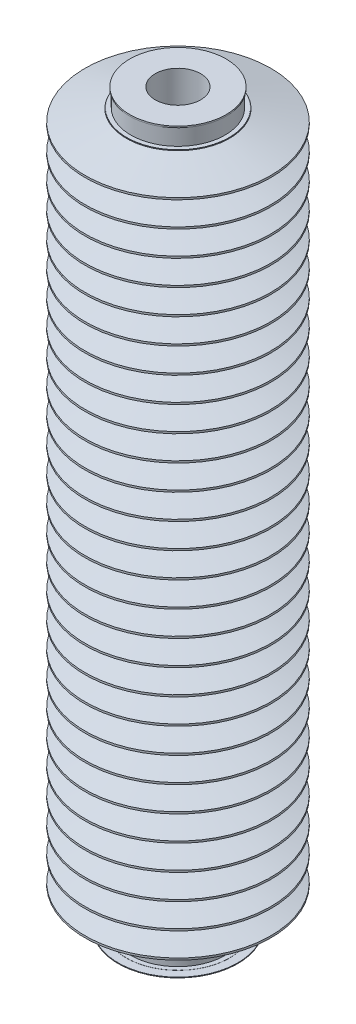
ISO-10303-21;
HEADER;
FILE_DESCRIPTION(('STEP AP214'),'2;1');
FILE_NAME('part.step','',(''),(''),'','','');
FILE_SCHEMA(('AUTOMOTIVE_DESIGN { 1 0 10303 214 1 1 1 1 }'));
ENDSEC;
DATA;
#1=APPLICATION_CONTEXT('core data for automotive mechanical design processes');
#2=APPLICATION_PROTOCOL_DEFINITION('international standard','automotive_design',2000,#1);
#3=PRODUCT_CONTEXT('',#1,'mechanical');
#4=PRODUCT('Part','Part','',(#3));
#5=PRODUCT_RELATED_PRODUCT_CATEGORY('part','',(#4));
#6=PRODUCT_DEFINITION_FORMATION('','',#4);
#7=PRODUCT_DEFINITION_CONTEXT('part definition',#1,'design');
#8=PRODUCT_DEFINITION('design','',#6,#7);
#9=PRODUCT_DEFINITION_SHAPE('','',#8);
#10=(LENGTH_UNIT() NAMED_UNIT(*) SI_UNIT(.MILLI.,.METRE.));
#11=(NAMED_UNIT(*) PLANE_ANGLE_UNIT() SI_UNIT($,.RADIAN.));
#12=(NAMED_UNIT(*) SI_UNIT($,.STERADIAN.) SOLID_ANGLE_UNIT());
#13=UNCERTAINTY_MEASURE_WITH_UNIT(LENGTH_MEASURE(1.E-05),#10,'distance_accuracy_value','');
#14=(GEOMETRIC_REPRESENTATION_CONTEXT(3) GLOBAL_UNCERTAINTY_ASSIGNED_CONTEXT((#13)) GLOBAL_UNIT_ASSIGNED_CONTEXT((#10,
#11,#12)) REPRESENTATION_CONTEXT('',''));
#15=CARTESIAN_POINT('',(0.,0.,0.));
#16=DIRECTION('',(0.,0.,1.));
#17=DIRECTION('',(1.,0.,0.));
#18=AXIS2_PLACEMENT_3D('',#15,#16,#17);
#19=CARTESIAN_POINT('',(25.,0.,0.));
#20=DIRECTION('',(0.,1.,0.));
#21=DIRECTION('',(1.,0.,0.));
#22=AXIS2_PLACEMENT_3D('',#19,#20,#21);
#23=PLANE('',#22);
#24=CARTESIAN_POINT('',(0.,0.,0.));
#25=DIRECTION('',(0.,-1.,0.));
#26=DIRECTION('',(0.,0.,-1.));
#27=AXIS2_PLACEMENT_3D('',#24,#25,#26);
#28=CIRCLE('',#27,25.);
#29=CARTESIAN_POINT('',(0.,0.,-25.));
#30=VERTEX_POINT('',#29);
#31=EDGE_CURVE('E11',#30,#30,#28,.T.);
#32=ORIENTED_EDGE('',*,*,#31,.T.);
#33=EDGE_LOOP('',(#32));
#34=FACE_BOUND('',#33,.T.);
#35=CARTESIAN_POINT('',(0.,0.,0.));
#36=DIRECTION('',(0.,-1.,0.));
#37=DIRECTION('',(0.,0.,-1.));
#38=AXIS2_PLACEMENT_3D('',#35,#36,#37);
#39=CIRCLE('',#38,11.);
#40=CARTESIAN_POINT('',(0.,0.,-11.));
#41=VERTEX_POINT('',#40);
#42=EDGE_CURVE('E701',#41,#41,#39,.T.);
#43=ORIENTED_EDGE('',*,*,#42,.F.);
#44=EDGE_LOOP('',(#43));
#45=FACE_BOUND('',#44,.T.);
#46=ADVANCED_FACE('F16',(#34,#45),#23,.F.);
#47=CARTESIAN_POINT('',(0.,0.,0.));
#48=DIRECTION('',(0.,1.,0.));
#49=DIRECTION('',(0.,0.,-1.));
#50=AXIS2_PLACEMENT_3D('',#47,#48,#49);
#51=CYLINDRICAL_SURFACE('',#50,25.);
#52=CARTESIAN_POINT('',(0.,0.3,0.));
#53=DIRECTION('',(0.,-1.,0.));
#54=DIRECTION('',(0.,0.,-1.));
#55=AXIS2_PLACEMENT_3D('',#52,#53,#54);
#56=CIRCLE('',#55,25.);
#57=CARTESIAN_POINT('',(0.,0.3,-25.));
#58=VERTEX_POINT('',#57);
#59=EDGE_CURVE('E27',#58,#58,#56,.T.);
#60=ORIENTED_EDGE('',*,*,#59,.T.);
#61=EDGE_LOOP('',(#60));
#62=FACE_BOUND('',#61,.T.);
#63=ORIENTED_EDGE('',*,*,#31,.F.);
#64=EDGE_LOOP('',(#63));
#65=FACE_BOUND('',#64,.T.);
#66=ADVANCED_FACE('F785',(#62,#65),#51,.T.);
#67=CARTESIAN_POINT('',(29.,0.3,0.));
#68=DIRECTION('',(0.,1.,0.));
#69=DIRECTION('',(1.,0.,0.));
#70=AXIS2_PLACEMENT_3D('',#67,#68,#69);
#71=PLANE('',#70);
#72=CARTESIAN_POINT('',(0.,0.3,0.));
#73=DIRECTION('',(0.,-1.,0.));
#74=DIRECTION('',(0.,0.,-1.));
#75=AXIS2_PLACEMENT_3D('',#72,#73,#74);
#76=CIRCLE('',#75,29.);
#77=CARTESIAN_POINT('',(0.,0.3,-29.));
#78=VERTEX_POINT('',#77);
#79=EDGE_CURVE('E554',#78,#78,#76,.T.);
#80=ORIENTED_EDGE('',*,*,#79,.T.);
#81=EDGE_LOOP('',(#80));
#82=FACE_BOUND('',#81,.T.);
#83=ORIENTED_EDGE('',*,*,#59,.F.);
#84=EDGE_LOOP('',(#83));
#85=FACE_BOUND('',#84,.T.);
#86=ADVANCED_FACE('F792',(#82,#85),#71,.F.);
#87=CARTESIAN_POINT('',(0.,0.,0.));
#88=DIRECTION('',(0.,1.,0.));
#89=DIRECTION('',(0.,0.,-1.));
#90=AXIS2_PLACEMENT_3D('',#87,#88,#89);
#91=CYLINDRICAL_SURFACE('',#90,29.);
#92=CARTESIAN_POINT('',(0.,0.65,0.));
#93=DIRECTION('',(0.,-1.,0.));
#94=DIRECTION('',(0.,0.,-1.));
#95=AXIS2_PLACEMENT_3D('',#92,#93,#94);
#96=CIRCLE('',#95,29.);
#97=CARTESIAN_POINT('',(0.,0.65,-29.));
#98=VERTEX_POINT('',#97);
#99=EDGE_CURVE('E550',#98,#98,#96,.T.);
#100=ORIENTED_EDGE('',*,*,#99,.T.);
#101=EDGE_LOOP('',(#100));
#102=FACE_BOUND('',#101,.T.);
#103=ORIENTED_EDGE('',*,*,#79,.F.);
#104=EDGE_LOOP('',(#103));
#105=FACE_BOUND('',#104,.T.);
#106=ADVANCED_FACE('F1039',(#102,#105),#91,.T.);
#107=CARTESIAN_POINT('',(25.,0.65,0.));
#108=DIRECTION('',(0.,-1.,0.));
#109=DIRECTION('',(0.,0.,-1.));
#110=AXIS2_PLACEMENT_3D('',#107,#108,#109);
#111=PLANE('',#110);
#112=ORIENTED_EDGE('',*,*,#99,.F.);
#113=EDGE_LOOP('',(#112));
#114=FACE_BOUND('',#113,.T.);
#115=CARTESIAN_POINT('',(0.,0.65,0.));
#116=DIRECTION('',(0.,-1.,0.));
#117=DIRECTION('',(0.,0.,-1.));
#118=AXIS2_PLACEMENT_3D('',#115,#116,#117);
#119=CIRCLE('',#118,25.);
#120=CARTESIAN_POINT('',(0.,0.65,-25.));
#121=VERTEX_POINT('',#120);
#122=EDGE_CURVE('E555',#121,#121,#119,.T.);
#123=ORIENTED_EDGE('',*,*,#122,.T.);
#124=EDGE_LOOP('',(#123));
#125=FACE_BOUND('',#124,.T.);
#126=ADVANCED_FACE('F1282',(#114,#125),#111,.F.);
#127=CARTESIAN_POINT('',(0.,0.,0.));
#128=DIRECTION('',(0.,1.,0.));
#129=DIRECTION('',(0.,0.,-1.));
#130=AXIS2_PLACEMENT_3D('',#127,#128,#129);
#131=CYLINDRICAL_SURFACE('',#130,25.);
#132=CARTESIAN_POINT('',(0.,0.7,0.));
#133=DIRECTION('',(0.,-1.,0.));
#134=DIRECTION('',(0.,0.,-1.));
#135=AXIS2_PLACEMENT_3D('',#132,#133,#134);
#136=CIRCLE('',#135,25.);
#137=CARTESIAN_POINT('',(0.,0.7,-25.));
#138=VERTEX_POINT('',#137);
#139=EDGE_CURVE('E560',#138,#138,#136,.T.);
#140=ORIENTED_EDGE('',*,*,#139,.T.);
#141=EDGE_LOOP('',(#140));
#142=FACE_BOUND('',#141,.T.);
#143=ORIENTED_EDGE('',*,*,#122,.F.);
#144=EDGE_LOOP('',(#143));
#145=FACE_BOUND('',#144,.T.);
#146=ADVANCED_FACE('F1105',(#142,#145),#131,.T.);
#147=CARTESIAN_POINT('',(22.85,0.7,0.));
#148=DIRECTION('',(0.,-1.,0.));
#149=DIRECTION('',(0.,0.,-1.));
#150=AXIS2_PLACEMENT_3D('',#147,#148,#149);
#151=PLANE('',#150);
#152=ORIENTED_EDGE('',*,*,#139,.F.);
#153=EDGE_LOOP('',(#152));
#154=FACE_BOUND('',#153,.T.);
#155=CARTESIAN_POINT('',(0.,0.7,0.));
#156=DIRECTION('',(0.,-1.,0.));
#157=DIRECTION('',(0.,0.,-1.));
#158=AXIS2_PLACEMENT_3D('',#155,#156,#157);
#159=CIRCLE('',#158,22.85);
#160=CARTESIAN_POINT('',(0.,0.7,-22.85));
#161=VERTEX_POINT('',#160);
#162=EDGE_CURVE('E556',#161,#161,#159,.T.);
#163=ORIENTED_EDGE('',*,*,#162,.T.);
#164=EDGE_LOOP('',(#163));
#165=FACE_BOUND('',#164,.T.);
#166=ADVANCED_FACE('F1094',(#154,#165),#151,.F.);
#167=CARTESIAN_POINT('',(0.,0.,0.));
#168=DIRECTION('',(0.,1.,0.));
#169=DIRECTION('',(0.,0.,-1.));
#170=AXIS2_PLACEMENT_3D('',#167,#168,#169);
#171=CYLINDRICAL_SURFACE('',#170,22.85);
#172=CARTESIAN_POINT('',(0.,12.95,0.));
#173=DIRECTION('',(0.,-1.,0.));
#174=DIRECTION('',(0.,0.,-1.));
#175=AXIS2_PLACEMENT_3D('',#172,#173,#174);
#176=CIRCLE('',#175,22.85);
#177=CARTESIAN_POINT('',(0.,12.95,-22.85));
#178=VERTEX_POINT('',#177);
#179=EDGE_CURVE('E561',#178,#178,#176,.T.);
#180=ORIENTED_EDGE('',*,*,#179,.T.);
#181=EDGE_LOOP('',(#180));
#182=FACE_BOUND('',#181,.T.);
#183=ORIENTED_EDGE('',*,*,#162,.F.);
#184=EDGE_LOOP('',(#183));
#185=FACE_BOUND('',#184,.T.);
#186=ADVANCED_FACE('F1090',(#182,#185),#171,.T.);
#187=CARTESIAN_POINT('',(24.85,12.95,0.));
#188=DIRECTION('',(0.,1.,0.));
#189=DIRECTION('',(1.,0.,0.));
#190=AXIS2_PLACEMENT_3D('',#187,#188,#189);
#191=PLANE('',#190);
#192=CARTESIAN_POINT('',(0.,12.95,0.));
#193=DIRECTION('',(0.,-1.,0.));
#194=DIRECTION('',(0.,0.,-1.));
#195=AXIS2_PLACEMENT_3D('',#192,#193,#194);
#196=CIRCLE('',#195,24.85);
#197=CARTESIAN_POINT('',(0.,12.95,-24.85));
#198=VERTEX_POINT('',#197);
#199=EDGE_CURVE('E620',#198,#198,#196,.T.);
#200=ORIENTED_EDGE('',*,*,#199,.T.);
#201=EDGE_LOOP('',(#200));
#202=FACE_BOUND('',#201,.T.);
#203=ORIENTED_EDGE('',*,*,#179,.F.);
#204=EDGE_LOOP('',(#203));
#205=FACE_BOUND('',#204,.T.);
#206=ADVANCED_FACE('F1093',(#202,#205),#191,.F.);
#207=CARTESIAN_POINT('',(0.,0.,0.));
#208=DIRECTION('',(0.,1.,0.));
#209=DIRECTION('',(0.,0.,-1.));
#210=AXIS2_PLACEMENT_3D('',#207,#208,#209);
#211=CYLINDRICAL_SURFACE('',#210,24.85);
#212=CARTESIAN_POINT('',(0.,13.4339,0.));
#213=DIRECTION('',(0.,-1.,0.));
#214=DIRECTION('',(0.,0.,-1.));
#215=AXIS2_PLACEMENT_3D('',#212,#213,#214);
#216=CIRCLE('',#215,24.85);
#217=CARTESIAN_POINT('',(0.,13.4339,-24.85));
#218=VERTEX_POINT('',#217);
#219=EDGE_CURVE('E566',#218,#218,#216,.T.);
#220=ORIENTED_EDGE('',*,*,#219,.T.);
#221=EDGE_LOOP('',(#220));
#222=FACE_BOUND('',#221,.T.);
#223=ORIENTED_EDGE('',*,*,#199,.F.);
#224=EDGE_LOOP('',(#223));
#225=FACE_BOUND('',#224,.T.);
#226=ADVANCED_FACE('F1177',(#222,#225),#211,.T.);
#227=CARTESIAN_POINT('',(0.,344.56557,0.));
#228=DIRECTION('',(0.,-1.,0.));
#229=DIRECTION('',(0.,0.,-1.));
#230=AXIS2_PLACEMENT_3D('',#227,#228,#229);
#231=PLANE('',#230);
#232=CARTESIAN_POINT('',(0.,344.56557,0.));
#233=DIRECTION('',(0.,-1.,0.));
#234=DIRECTION('',(0.,0.,-1.));
#235=AXIS2_PLACEMENT_3D('',#232,#233,#234);
#236=CIRCLE('',#235,25.0491794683);
#237=CARTESIAN_POINT('',(0.,344.56557,-25.0491794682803));
#238=VERTEX_POINT('',#237);
#239=EDGE_CURVE('E567',#238,#238,#236,.T.);
#240=ORIENTED_EDGE('',*,*,#239,.F.);
#241=EDGE_LOOP('',(#240));
#242=FACE_BOUND('',#241,.T.);
#243=CARTESIAN_POINT('',(0.,344.56557,0.));
#244=DIRECTION('',(0.,-1.,0.));
#245=DIRECTION('',(0.,0.,-1.));
#246=AXIS2_PLACEMENT_3D('',#243,#244,#245);
#247=CIRCLE('',#246,24.85);
#248=CARTESIAN_POINT('',(0.,344.56557,-24.85));
#249=VERTEX_POINT('',#248);
#250=EDGE_CURVE('E562',#249,#249,#247,.T.);
#251=ORIENTED_EDGE('',*,*,#250,.T.);
#252=EDGE_LOOP('',(#251));
#253=FACE_BOUND('',#252,.T.);
#254=ADVANCED_FACE('F1180',(#242,#253),#231,.F.);
#255=CARTESIAN_POINT('',(0.,344.56557,0.));
#256=DIRECTION('',(0.,-1.,0.));
#257=DIRECTION('',(0.,0.,-1.));
#258=AXIS2_PLACEMENT_3D('',#255,#256,#257);
#259=CONICAL_SURFACE('',#258,25.0491794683,1.298138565);
#260=CARTESIAN_POINT('',(0.,338.98689,0.));
#261=DIRECTION('',(0.,-1.,0.));
#262=DIRECTION('',(0.,0.,-1.));
#263=AXIS2_PLACEMENT_3D('',#260,#261,#262);
#264=CIRCLE('',#263,45.);
#265=CARTESIAN_POINT('',(0.,338.98689,-45.));
#266=VERTEX_POINT('',#265);
#267=EDGE_CURVE('E901',#266,#266,#264,.T.);
#268=ORIENTED_EDGE('',*,*,#267,.F.);
#269=EDGE_LOOP('',(#268));
#270=FACE_BOUND('',#269,.T.);
#271=ORIENTED_EDGE('',*,*,#239,.T.);
#272=EDGE_LOOP('',(#271));
#273=FACE_BOUND('',#272,.T.);
#274=ADVANCED_FACE('F1200',(#270,#273),#259,.T.);
#275=CARTESIAN_POINT('',(0.,13.4339,0.));
#276=DIRECTION('',(0.,1.,0.));
#277=DIRECTION('',(0.,0.,-1.));
#278=AXIS2_PLACEMENT_3D('',#275,#276,#277);
#279=CYLINDRICAL_SURFACE('',#278,45.);
#280=ORIENTED_EDGE('',*,*,#267,.T.);
#281=EDGE_LOOP('',(#280));
#282=FACE_BOUND('',#281,.T.);
#283=CARTESIAN_POINT('',(0.,338.055722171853,0.));
#284=DIRECTION('',(0.,-1.,0.));
#285=DIRECTION('',(0.,0.,-1.));
#286=AXIS2_PLACEMENT_3D('',#283,#284,#285);
#287=CIRCLE('',#286,45.);
#288=CARTESIAN_POINT('',(0.,338.055722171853,-45.));
#289=VERTEX_POINT('',#288);
#290=EDGE_CURVE('E905',#289,#289,#287,.T.);
#291=ORIENTED_EDGE('',*,*,#290,.F.);
#292=EDGE_LOOP('',(#291));
#293=FACE_BOUND('',#292,.T.);
#294=ADVANCED_FACE('F804',(#282,#293),#279,.T.);
#295=CARTESIAN_POINT('',(0.,338.055722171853,0.));
#296=DIRECTION('',(0.,1.,0.));
#297=DIRECTION('',(0.,0.,1.));
#298=AXIS2_PLACEMENT_3D('',#295,#296,#297);
#299=CONICAL_SURFACE('',#298,45.,1.298140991);
#300=ORIENTED_EDGE('',*,*,#290,.T.);
#301=EDGE_LOOP('',(#300));
#302=FACE_BOUND('',#301,.T.);
#303=CARTESIAN_POINT('',(0.,332.4214,0.));
#304=DIRECTION('',(0.,-1.,0.));
#305=DIRECTION('',(0.,0.,-1.));
#306=AXIS2_PLACEMENT_3D('',#303,#304,#305);
#307=CIRCLE('',#306,24.85);
#308=CARTESIAN_POINT('',(0.,332.4214,-24.85));
#309=VERTEX_POINT('',#308);
#310=EDGE_CURVE('E677',#309,#309,#307,.T.);
#311=ORIENTED_EDGE('',*,*,#310,.F.);
#312=EDGE_LOOP('',(#311));
#313=FACE_BOUND('',#312,.T.);
#314=ADVANCED_FACE('F800',(#302,#313),#299,.T.);
#315=CARTESIAN_POINT('',(0.,13.4339,0.));
#316=DIRECTION('',(0.,1.,0.));
#317=DIRECTION('',(0.,0.,-1.));
#318=AXIS2_PLACEMENT_3D('',#315,#316,#317);
#319=CYLINDRICAL_SURFACE('',#318,24.85);
#320=ORIENTED_EDGE('',*,*,#310,.T.);
#321=EDGE_LOOP('',(#320));
#322=FACE_BOUND('',#321,.T.);
#323=CARTESIAN_POINT('',(0.,332.35251487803,0.));
#324=DIRECTION('',(0.,-1.,0.));
#325=DIRECTION('',(0.,0.,-1.));
#326=AXIS2_PLACEMENT_3D('',#323,#324,#325);
#327=CIRCLE('',#326,24.85);
#328=CARTESIAN_POINT('',(0.,332.35251487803,-24.85));
#329=VERTEX_POINT('',#328);
#330=EDGE_CURVE('E468',#329,#329,#327,.T.);
#331=ORIENTED_EDGE('',*,*,#330,.F.);
#332=EDGE_LOOP('',(#331));
#333=FACE_BOUND('',#332,.T.);
#334=ADVANCED_FACE('F803',(#322,#333),#319,.T.);
#335=CARTESIAN_POINT('',(0.,332.35251487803,0.));
#336=DIRECTION('',(0.,-1.,0.));
#337=DIRECTION('',(0.,0.,-1.));
#338=AXIS2_PLACEMENT_3D('',#335,#336,#337);
#339=CONICAL_SURFACE('',#338,24.85,1.298138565);
#340=CARTESIAN_POINT('',(0.,326.71814,0.));
#341=DIRECTION('',(0.,-1.,0.));
#342=DIRECTION('',(0.,0.,-1.));
#343=AXIS2_PLACEMENT_3D('',#340,#341,#342);
#344=CIRCLE('',#343,45.);
#345=CARTESIAN_POINT('',(0.,326.71814,-45.));
#346=VERTEX_POINT('',#345);
#347=EDGE_CURVE('E420',#346,#346,#344,.T.);
#348=ORIENTED_EDGE('',*,*,#347,.F.);
#349=EDGE_LOOP('',(#348));
#350=FACE_BOUND('',#349,.T.);
#351=ORIENTED_EDGE('',*,*,#330,.T.);
#352=EDGE_LOOP('',(#351));
#353=FACE_BOUND('',#352,.T.);
#354=ADVANCED_FACE('F1078',(#350,#353),#339,.T.);
#355=CARTESIAN_POINT('',(0.,13.4339,0.));
#356=DIRECTION('',(0.,1.,0.));
#357=DIRECTION('',(0.,0.,-1.));
#358=AXIS2_PLACEMENT_3D('',#355,#356,#357);
#359=CYLINDRICAL_SURFACE('',#358,45.);
#360=ORIENTED_EDGE('',*,*,#347,.T.);
#361=EDGE_LOOP('',(#360));
#362=FACE_BOUND('',#361,.T.);
#363=CARTESIAN_POINT('',(0.,325.786972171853,0.));
#364=DIRECTION('',(0.,-1.,0.));
#365=DIRECTION('',(0.,0.,-1.));
#366=AXIS2_PLACEMENT_3D('',#363,#364,#365);
#367=CIRCLE('',#366,45.);
#368=CARTESIAN_POINT('',(0.,325.786972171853,-45.));
#369=VERTEX_POINT('',#368);
#370=EDGE_CURVE('E411',#369,#369,#367,.T.);
#371=ORIENTED_EDGE('',*,*,#370,.F.);
#372=EDGE_LOOP('',(#371));
#373=FACE_BOUND('',#372,.T.);
#374=ADVANCED_FACE('F1074',(#362,#373),#359,.T.);
#375=CARTESIAN_POINT('',(0.,325.786972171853,0.));
#376=DIRECTION('',(0.,1.,0.));
#377=DIRECTION('',(0.,0.,1.));
#378=AXIS2_PLACEMENT_3D('',#375,#376,#377);
#379=CONICAL_SURFACE('',#378,45.,1.298140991);
#380=ORIENTED_EDGE('',*,*,#370,.T.);
#381=EDGE_LOOP('',(#380));
#382=FACE_BOUND('',#381,.T.);
#383=CARTESIAN_POINT('',(0.,320.15265,0.));
#384=DIRECTION('',(0.,-1.,0.));
#385=DIRECTION('',(0.,0.,-1.));
#386=AXIS2_PLACEMENT_3D('',#383,#384,#385);
#387=CIRCLE('',#386,24.85);
#388=CARTESIAN_POINT('',(0.,320.15265,-24.85));
#389=VERTEX_POINT('',#388);
#390=EDGE_CURVE('E473',#389,#389,#387,.T.);
#391=ORIENTED_EDGE('',*,*,#390,.F.);
#392=EDGE_LOOP('',(#391));
#393=FACE_BOUND('',#392,.T.);
#394=ADVANCED_FACE('F1077',(#382,#393),#379,.T.);
#395=CARTESIAN_POINT('',(0.,13.4339,0.));
#396=DIRECTION('',(0.,1.,0.));
#397=DIRECTION('',(0.,0.,-1.));
#398=AXIS2_PLACEMENT_3D('',#395,#396,#397);
#399=CYLINDRICAL_SURFACE('',#398,24.85);
#400=ORIENTED_EDGE('',*,*,#390,.T.);
#401=EDGE_LOOP('',(#400));
#402=FACE_BOUND('',#401,.T.);
#403=CARTESIAN_POINT('',(0.,320.08376487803,0.));
#404=DIRECTION('',(0.,-1.,0.));
#405=DIRECTION('',(0.,0.,-1.));
#406=AXIS2_PLACEMENT_3D('',#403,#404,#405);
#407=CIRCLE('',#406,24.85);
#408=CARTESIAN_POINT('',(0.,320.08376487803,-24.85));
#409=VERTEX_POINT('',#408);
#410=EDGE_CURVE('E477',#409,#409,#407,.T.);
#411=ORIENTED_EDGE('',*,*,#410,.F.);
#412=EDGE_LOOP('',(#411));
#413=FACE_BOUND('',#412,.T.);
#414=ADVANCED_FACE('F1150',(#402,#413),#399,.T.);
#415=CARTESIAN_POINT('',(0.,320.08376487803,0.));
#416=DIRECTION('',(0.,-1.,0.));
#417=DIRECTION('',(0.,0.,-1.));
#418=AXIS2_PLACEMENT_3D('',#415,#416,#417);
#419=CONICAL_SURFACE('',#418,24.85,1.298138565);
#420=CARTESIAN_POINT('',(0.,314.44939,0.));
#421=DIRECTION('',(0.,-1.,0.));
#422=DIRECTION('',(0.,0.,-1.));
#423=AXIS2_PLACEMENT_3D('',#420,#421,#422);
#424=CIRCLE('',#423,45.);
#425=CARTESIAN_POINT('',(0.,314.44939,-45.));
#426=VERTEX_POINT('',#425);
#427=EDGE_CURVE('E919',#426,#426,#424,.T.);
#428=ORIENTED_EDGE('',*,*,#427,.F.);
#429=EDGE_LOOP('',(#428));
#430=FACE_BOUND('',#429,.T.);
#431=ORIENTED_EDGE('',*,*,#410,.T.);
#432=EDGE_LOOP('',(#431));
#433=FACE_BOUND('',#432,.T.);
#434=ADVANCED_FACE('F1225',(#430,#433),#419,.T.);
#435=CARTESIAN_POINT('',(0.,13.4339,0.));
#436=DIRECTION('',(0.,1.,0.));
#437=DIRECTION('',(0.,0.,-1.));
#438=AXIS2_PLACEMENT_3D('',#435,#436,#437);
#439=CYLINDRICAL_SURFACE('',#438,45.);
#440=ORIENTED_EDGE('',*,*,#427,.T.);
#441=EDGE_LOOP('',(#440));
#442=FACE_BOUND('',#441,.T.);
#443=CARTESIAN_POINT('',(0.,313.518222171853,0.));
#444=DIRECTION('',(0.,-1.,0.));
#445=DIRECTION('',(0.,0.,-1.));
#446=AXIS2_PLACEMENT_3D('',#443,#444,#445);
#447=CIRCLE('',#446,45.);
#448=CARTESIAN_POINT('',(0.,313.518222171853,-45.));
#449=VERTEX_POINT('',#448);
#450=EDGE_CURVE('E734',#449,#449,#447,.T.);
#451=ORIENTED_EDGE('',*,*,#450,.F.);
#452=EDGE_LOOP('',(#451));
#453=FACE_BOUND('',#452,.T.);
#454=ADVANCED_FACE('F1184',(#442,#453),#439,.T.);
#455=CARTESIAN_POINT('',(0.,313.518222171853,0.));
#456=DIRECTION('',(0.,1.,0.));
#457=DIRECTION('',(0.,0.,1.));
#458=AXIS2_PLACEMENT_3D('',#455,#456,#457);
#459=CONICAL_SURFACE('',#458,45.,1.298140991);
#460=ORIENTED_EDGE('',*,*,#450,.T.);
#461=EDGE_LOOP('',(#460));
#462=FACE_BOUND('',#461,.T.);
#463=CARTESIAN_POINT('',(0.,307.8839,0.));
#464=DIRECTION('',(0.,-1.,0.));
#465=DIRECTION('',(0.,0.,-1.));
#466=AXIS2_PLACEMENT_3D('',#463,#464,#465);
#467=CIRCLE('',#466,24.85);
#468=CARTESIAN_POINT('',(0.,307.8839,-24.85));
#469=VERTEX_POINT('',#468);
#470=EDGE_CURVE('E548',#469,#469,#467,.T.);
#471=ORIENTED_EDGE('',*,*,#470,.F.);
#472=EDGE_LOOP('',(#471));
#473=FACE_BOUND('',#472,.T.);
#474=ADVANCED_FACE('F1067',(#462,#473),#459,.T.);
#475=CARTESIAN_POINT('',(0.,13.4339,0.));
#476=DIRECTION('',(0.,1.,0.));
#477=DIRECTION('',(0.,0.,-1.));
#478=AXIS2_PLACEMENT_3D('',#475,#476,#477);
#479=CYLINDRICAL_SURFACE('',#478,24.85);
#480=ORIENTED_EDGE('',*,*,#470,.T.);
#481=EDGE_LOOP('',(#480));
#482=FACE_BOUND('',#481,.T.);
#483=CARTESIAN_POINT('',(0.,307.81501487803,0.));
#484=DIRECTION('',(0.,-1.,0.));
#485=DIRECTION('',(0.,0.,-1.));
#486=AXIS2_PLACEMENT_3D('',#483,#484,#485);
#487=CIRCLE('',#486,24.85);
#488=CARTESIAN_POINT('',(0.,307.81501487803,-24.85));
#489=VERTEX_POINT('',#488);
#490=EDGE_CURVE('E544',#489,#489,#487,.T.);
#491=ORIENTED_EDGE('',*,*,#490,.F.);
#492=EDGE_LOOP('',(#491));
#493=FACE_BOUND('',#492,.T.);
#494=ADVANCED_FACE('F1063',(#482,#493),#479,.T.);
#495=CARTESIAN_POINT('',(0.,307.81501487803,0.));
#496=DIRECTION('',(0.,-1.,0.));
#497=DIRECTION('',(0.,0.,-1.));
#498=AXIS2_PLACEMENT_3D('',#495,#496,#497);
#499=CONICAL_SURFACE('',#498,24.85,1.298138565);
#500=CARTESIAN_POINT('',(0.,302.18064,0.));
#501=DIRECTION('',(0.,-1.,0.));
#502=DIRECTION('',(0.,0.,-1.));
#503=AXIS2_PLACEMENT_3D('',#500,#501,#502);
#504=CIRCLE('',#503,45.);
#505=CARTESIAN_POINT('',(0.,302.18064,-45.));
#506=VERTEX_POINT('',#505);
#507=EDGE_CURVE('E549',#506,#506,#504,.T.);
#508=ORIENTED_EDGE('',*,*,#507,.F.);
#509=EDGE_LOOP('',(#508));
#510=FACE_BOUND('',#509,.T.);
#511=ORIENTED_EDGE('',*,*,#490,.T.);
#512=EDGE_LOOP('',(#511));
#513=FACE_BOUND('',#512,.T.);
#514=ADVANCED_FACE('F1066',(#510,#513),#499,.T.);
#515=CARTESIAN_POINT('',(0.,13.4339,0.));
#516=DIRECTION('',(0.,1.,0.));
#517=DIRECTION('',(0.,0.,-1.));
#518=AXIS2_PLACEMENT_3D('',#515,#516,#517);
#519=CYLINDRICAL_SURFACE('',#518,45.);
#520=ORIENTED_EDGE('',*,*,#507,.T.);
#521=EDGE_LOOP('',(#520));
#522=FACE_BOUND('',#521,.T.);
#523=CARTESIAN_POINT('',(0.,301.249472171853,0.));
#524=DIRECTION('',(0.,-1.,0.));
#525=DIRECTION('',(0.,0.,-1.));
#526=AXIS2_PLACEMENT_3D('',#523,#524,#525);
#527=CIRCLE('',#526,45.);
#528=CARTESIAN_POINT('',(0.,301.249472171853,-45.));
#529=VERTEX_POINT('',#528);
#530=EDGE_CURVE('E667',#529,#529,#527,.T.);
#531=ORIENTED_EDGE('',*,*,#530,.F.);
#532=EDGE_LOOP('',(#531));
#533=FACE_BOUND('',#532,.T.);
#534=ADVANCED_FACE('F1097',(#522,#533),#519,.T.);
#535=CARTESIAN_POINT('',(0.,301.249472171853,0.));
#536=DIRECTION('',(0.,1.,0.));
#537=DIRECTION('',(0.,0.,1.));
#538=AXIS2_PLACEMENT_3D('',#535,#536,#537);
#539=CONICAL_SURFACE('',#538,45.,1.298140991);
#540=ORIENTED_EDGE('',*,*,#530,.T.);
#541=EDGE_LOOP('',(#540));
#542=FACE_BOUND('',#541,.T.);
#543=CARTESIAN_POINT('',(0.,295.61515,0.));
#544=DIRECTION('',(0.,-1.,0.));
#545=DIRECTION('',(0.,0.,-1.));
#546=AXIS2_PLACEMENT_3D('',#543,#544,#545);
#547=CIRCLE('',#546,24.85);
#548=CARTESIAN_POINT('',(0.,295.61515,-24.85));
#549=VERTEX_POINT('',#548);
#550=EDGE_CURVE('E488',#549,#549,#547,.T.);
#551=ORIENTED_EDGE('',*,*,#550,.F.);
#552=EDGE_LOOP('',(#551));
#553=FACE_BOUND('',#552,.T.);
#554=ADVANCED_FACE('F1251',(#542,#553),#539,.T.);
#555=CARTESIAN_POINT('',(0.,13.4339,0.));
#556=DIRECTION('',(0.,1.,0.));
#557=DIRECTION('',(0.,0.,-1.));
#558=AXIS2_PLACEMENT_3D('',#555,#556,#557);
#559=CYLINDRICAL_SURFACE('',#558,24.85);
#560=ORIENTED_EDGE('',*,*,#550,.T.);
#561=EDGE_LOOP('',(#560));
#562=FACE_BOUND('',#561,.T.);
#563=CARTESIAN_POINT('',(0.,295.54626487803,0.));
#564=DIRECTION('',(0.,-1.,0.));
#565=DIRECTION('',(0.,0.,-1.));
#566=AXIS2_PLACEMENT_3D('',#563,#564,#565);
#567=CIRCLE('',#566,24.85);
#568=CARTESIAN_POINT('',(0.,295.54626487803,-24.85));
#569=VERTEX_POINT('',#568);
#570=EDGE_CURVE('E484',#569,#569,#567,.T.);
#571=ORIENTED_EDGE('',*,*,#570,.F.);
#572=EDGE_LOOP('',(#571));
#573=FACE_BOUND('',#572,.T.);
#574=ADVANCED_FACE('F828',(#562,#573),#559,.T.);
#575=CARTESIAN_POINT('',(0.,295.54626487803,0.));
#576=DIRECTION('',(0.,-1.,0.));
#577=DIRECTION('',(0.,0.,-1.));
#578=AXIS2_PLACEMENT_3D('',#575,#576,#577);
#579=CONICAL_SURFACE('',#578,24.85,1.298138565);
#580=CARTESIAN_POINT('',(0.,289.91189,0.));
#581=DIRECTION('',(0.,-1.,0.));
#582=DIRECTION('',(0.,0.,-1.));
#583=AXIS2_PLACEMENT_3D('',#580,#581,#582);
#584=CIRCLE('',#583,45.);
#585=CARTESIAN_POINT('',(0.,289.91189,-45.));
#586=VERTEX_POINT('',#585);
#587=EDGE_CURVE('E489',#586,#586,#584,.T.);
#588=ORIENTED_EDGE('',*,*,#587,.F.);
#589=EDGE_LOOP('',(#588));
#590=FACE_BOUND('',#589,.T.);
#591=ORIENTED_EDGE('',*,*,#570,.T.);
#592=EDGE_LOOP('',(#591));
#593=FACE_BOUND('',#592,.T.);
#594=ADVANCED_FACE('F824',(#590,#593),#579,.T.);
#595=CARTESIAN_POINT('',(0.,13.4339,0.));
#596=DIRECTION('',(0.,1.,0.));
#597=DIRECTION('',(0.,0.,-1.));
#598=AXIS2_PLACEMENT_3D('',#595,#596,#597);
#599=CYLINDRICAL_SURFACE('',#598,45.);
#600=ORIENTED_EDGE('',*,*,#587,.T.);
#601=EDGE_LOOP('',(#600));
#602=FACE_BOUND('',#601,.T.);
#603=CARTESIAN_POINT('',(0.,288.980722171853,0.));
#604=DIRECTION('',(0.,-1.,0.));
#605=DIRECTION('',(0.,0.,-1.));
#606=AXIS2_PLACEMENT_3D('',#603,#604,#605);
#607=CIRCLE('',#606,45.);
#608=CARTESIAN_POINT('',(0.,288.980722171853,-45.));
#609=VERTEX_POINT('',#608);
#610=EDGE_CURVE('E490',#609,#609,#607,.T.);
#611=ORIENTED_EDGE('',*,*,#610,.F.);
#612=EDGE_LOOP('',(#611));
#613=FACE_BOUND('',#612,.T.);
#614=ADVANCED_FACE('F827',(#602,#613),#599,.T.);
#615=CARTESIAN_POINT('',(0.,288.980722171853,0.));
#616=DIRECTION('',(0.,1.,0.));
#617=DIRECTION('',(0.,0.,1.));
#618=AXIS2_PLACEMENT_3D('',#615,#616,#617);
#619=CONICAL_SURFACE('',#618,45.,1.298140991);
#620=ORIENTED_EDGE('',*,*,#610,.T.);
#621=EDGE_LOOP('',(#620));
#622=FACE_BOUND('',#621,.T.);
#623=CARTESIAN_POINT('',(0.,283.3464,0.));
#624=DIRECTION('',(0.,-1.,0.));
#625=DIRECTION('',(0.,0.,-1.));
#626=AXIS2_PLACEMENT_3D('',#623,#624,#625);
#627=CIRCLE('',#626,24.85);
#628=CARTESIAN_POINT('',(0.,283.3464,-24.85));
#629=VERTEX_POINT('',#628);
#630=EDGE_CURVE('E493',#629,#629,#627,.T.);
#631=ORIENTED_EDGE('',*,*,#630,.F.);
#632=EDGE_LOOP('',(#631));
#633=FACE_BOUND('',#632,.T.);
#634=ADVANCED_FACE('F1051',(#622,#633),#619,.T.);
#635=CARTESIAN_POINT('',(0.,13.4339,0.));
#636=DIRECTION('',(0.,1.,0.));
#637=DIRECTION('',(0.,0.,-1.));
#638=AXIS2_PLACEMENT_3D('',#635,#636,#637);
#639=CYLINDRICAL_SURFACE('',#638,24.85);
#640=ORIENTED_EDGE('',*,*,#630,.T.);
#641=EDGE_LOOP('',(#640));
#642=FACE_BOUND('',#641,.T.);
#643=CARTESIAN_POINT('',(0.,283.27751487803,0.));
#644=DIRECTION('',(0.,-1.,0.));
#645=DIRECTION('',(0.,0.,-1.));
#646=AXIS2_PLACEMENT_3D('',#643,#644,#645);
#647=CIRCLE('',#646,24.85);
#648=CARTESIAN_POINT('',(0.,283.27751487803,-24.85));
#649=VERTEX_POINT('',#648);
#650=EDGE_CURVE('E572',#649,#649,#647,.T.);
#651=ORIENTED_EDGE('',*,*,#650,.F.);
#652=EDGE_LOOP('',(#651));
#653=FACE_BOUND('',#652,.T.);
#654=ADVANCED_FACE('F1044',(#642,#653),#639,.T.);
#655=CARTESIAN_POINT('',(0.,283.27751487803,0.));
#656=DIRECTION('',(0.,-1.,0.));
#657=DIRECTION('',(0.,0.,-1.));
#658=AXIS2_PLACEMENT_3D('',#655,#656,#657);
#659=CONICAL_SURFACE('',#658,24.85,1.298138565);
#660=CARTESIAN_POINT('',(0.,277.64314,0.));
#661=DIRECTION('',(0.,-1.,0.));
#662=DIRECTION('',(0.,0.,-1.));
#663=AXIS2_PLACEMENT_3D('',#660,#661,#662);
#664=CIRCLE('',#663,45.);
#665=CARTESIAN_POINT('',(0.,277.64314,-45.));
#666=VERTEX_POINT('',#665);
#667=EDGE_CURVE('E568',#666,#666,#664,.T.);
#668=ORIENTED_EDGE('',*,*,#667,.F.);
#669=EDGE_LOOP('',(#668));
#670=FACE_BOUND('',#669,.T.);
#671=ORIENTED_EDGE('',*,*,#650,.T.);
#672=EDGE_LOOP('',(#671));
#673=FACE_BOUND('',#672,.T.);
#674=ADVANCED_FACE('F1041',(#670,#673),#659,.T.);
#675=CARTESIAN_POINT('',(0.,13.4339,0.));
#676=DIRECTION('',(0.,1.,0.));
#677=DIRECTION('',(0.,0.,-1.));
#678=AXIS2_PLACEMENT_3D('',#675,#676,#677);
#679=CYLINDRICAL_SURFACE('',#678,45.);
#680=ORIENTED_EDGE('',*,*,#667,.T.);
#681=EDGE_LOOP('',(#680));
#682=FACE_BOUND('',#681,.T.);
#683=CARTESIAN_POINT('',(0.,276.711972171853,0.));
#684=DIRECTION('',(0.,-1.,0.));
#685=DIRECTION('',(0.,0.,-1.));
#686=AXIS2_PLACEMENT_3D('',#683,#684,#685);
#687=CIRCLE('',#686,45.);
#688=CARTESIAN_POINT('',(0.,276.711972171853,-45.));
#689=VERTEX_POINT('',#688);
#690=EDGE_CURVE('E573',#689,#689,#687,.T.);
#691=ORIENTED_EDGE('',*,*,#690,.F.);
#692=EDGE_LOOP('',(#691));
#693=FACE_BOUND('',#692,.T.);
#694=ADVANCED_FACE('F816',(#682,#693),#679,.T.);
#695=CARTESIAN_POINT('',(0.,276.711972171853,0.));
#696=DIRECTION('',(0.,1.,0.));
#697=DIRECTION('',(0.,0.,1.));
#698=AXIS2_PLACEMENT_3D('',#695,#696,#697);
#699=CONICAL_SURFACE('',#698,45.,1.298140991);
#700=ORIENTED_EDGE('',*,*,#690,.T.);
#701=EDGE_LOOP('',(#700));
#702=FACE_BOUND('',#701,.T.);
#703=CARTESIAN_POINT('',(0.,271.07765,0.));
#704=DIRECTION('',(0.,-1.,0.));
#705=DIRECTION('',(0.,0.,-1.));
#706=AXIS2_PLACEMENT_3D('',#703,#704,#705);
#707=CIRCLE('',#706,24.85);
#708=CARTESIAN_POINT('',(0.,271.07765,-24.85));
#709=VERTEX_POINT('',#708);
#710=EDGE_CURVE('E929',#709,#709,#707,.T.);
#711=ORIENTED_EDGE('',*,*,#710,.F.);
#712=EDGE_LOOP('',(#711));
#713=FACE_BOUND('',#712,.T.);
#714=ADVANCED_FACE('F812',(#702,#713),#699,.T.);
#715=CARTESIAN_POINT('',(0.,13.4339,0.));
#716=DIRECTION('',(0.,1.,0.));
#717=DIRECTION('',(0.,0.,-1.));
#718=AXIS2_PLACEMENT_3D('',#715,#716,#717);
#719=CYLINDRICAL_SURFACE('',#718,24.85);
#720=ORIENTED_EDGE('',*,*,#710,.T.);
#721=EDGE_LOOP('',(#720));
#722=FACE_BOUND('',#721,.T.);
#723=CARTESIAN_POINT('',(0.,271.00876487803,0.));
#724=DIRECTION('',(0.,-1.,0.));
#725=DIRECTION('',(0.,0.,-1.));
#726=AXIS2_PLACEMENT_3D('',#723,#724,#725);
#727=CIRCLE('',#726,24.85);
#728=CARTESIAN_POINT('',(0.,271.00876487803,-24.85));
#729=VERTEX_POINT('',#728);
#730=EDGE_CURVE('E499',#729,#729,#727,.T.);
#731=ORIENTED_EDGE('',*,*,#730,.F.);
#732=EDGE_LOOP('',(#731));
#733=FACE_BOUND('',#732,.T.);
#734=ADVANCED_FACE('F815',(#722,#733),#719,.T.);
#735=CARTESIAN_POINT('',(0.,271.00876487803,0.));
#736=DIRECTION('',(0.,-1.,0.));
#737=DIRECTION('',(0.,0.,-1.));
#738=AXIS2_PLACEMENT_3D('',#735,#736,#737);
#739=CONICAL_SURFACE('',#738,24.85,1.298138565);
#740=CARTESIAN_POINT('',(0.,265.37439,0.));
#741=DIRECTION('',(0.,-1.,0.));
#742=DIRECTION('',(0.,0.,-1.));
#743=AXIS2_PLACEMENT_3D('',#740,#741,#742);
#744=CIRCLE('',#743,45.);
#745=CARTESIAN_POINT('',(0.,265.37439,-45.));
#746=VERTEX_POINT('',#745);
#747=EDGE_CURVE('E495',#746,#746,#744,.T.);
#748=ORIENTED_EDGE('',*,*,#747,.F.);
#749=EDGE_LOOP('',(#748));
#750=FACE_BOUND('',#749,.T.);
#751=ORIENTED_EDGE('',*,*,#730,.T.);
#752=EDGE_LOOP('',(#751));
#753=FACE_BOUND('',#752,.T.);
#754=ADVANCED_FACE('F856',(#750,#753),#739,.T.);
#755=CARTESIAN_POINT('',(0.,13.4339,0.));
#756=DIRECTION('',(0.,1.,0.));
#757=DIRECTION('',(0.,0.,-1.));
#758=AXIS2_PLACEMENT_3D('',#755,#756,#757);
#759=CYLINDRICAL_SURFACE('',#758,45.);
#760=ORIENTED_EDGE('',*,*,#747,.T.);
#761=EDGE_LOOP('',(#760));
#762=FACE_BOUND('',#761,.T.);
#763=CARTESIAN_POINT('',(0.,264.443222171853,0.));
#764=DIRECTION('',(0.,-1.,0.));
#765=DIRECTION('',(0.,0.,-1.));
#766=AXIS2_PLACEMENT_3D('',#763,#764,#765);
#767=CIRCLE('',#766,45.);
#768=CARTESIAN_POINT('',(0.,264.443222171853,-45.));
#769=VERTEX_POINT('',#768);
#770=EDGE_CURVE('E500',#769,#769,#767,.T.);
#771=ORIENTED_EDGE('',*,*,#770,.F.);
#772=EDGE_LOOP('',(#771));
#773=FACE_BOUND('',#772,.T.);
#774=ADVANCED_FACE('F1267',(#762,#773),#759,.T.);
#775=CARTESIAN_POINT('',(0.,264.443222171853,0.));
#776=DIRECTION('',(0.,1.,0.));
#777=DIRECTION('',(0.,0.,1.));
#778=AXIS2_PLACEMENT_3D('',#775,#776,#777);
#779=CONICAL_SURFACE('',#778,45.,1.298140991);
#780=ORIENTED_EDGE('',*,*,#770,.T.);
#781=EDGE_LOOP('',(#780));
#782=FACE_BOUND('',#781,.T.);
#783=CARTESIAN_POINT('',(0.,258.8089,0.));
#784=DIRECTION('',(0.,-1.,0.));
#785=DIRECTION('',(0.,0.,-1.));
#786=AXIS2_PLACEMENT_3D('',#783,#784,#785);
#787=CIRCLE('',#786,24.85);
#788=CARTESIAN_POINT('',(0.,258.8089,-24.85));
#789=VERTEX_POINT('',#788);
#790=EDGE_CURVE('E589',#789,#789,#787,.T.);
#791=ORIENTED_EDGE('',*,*,#790,.F.);
#792=EDGE_LOOP('',(#791));
#793=FACE_BOUND('',#792,.T.);
#794=ADVANCED_FACE('F1540',(#782,#793),#779,.T.);
#795=CARTESIAN_POINT('',(0.,13.4339,0.));
#796=DIRECTION('',(0.,1.,0.));
#797=DIRECTION('',(0.,0.,-1.));
#798=AXIS2_PLACEMENT_3D('',#795,#796,#797);
#799=CYLINDRICAL_SURFACE('',#798,24.85);
#800=ORIENTED_EDGE('',*,*,#790,.T.);
#801=EDGE_LOOP('',(#800));
#802=FACE_BOUND('',#801,.T.);
#803=CARTESIAN_POINT('',(0.,258.74001487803,0.));
#804=DIRECTION('',(0.,-1.,0.));
#805=DIRECTION('',(0.,0.,-1.));
#806=AXIS2_PLACEMENT_3D('',#803,#804,#805);
#807=CIRCLE('',#806,24.85);
#808=CARTESIAN_POINT('',(0.,258.74001487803,-24.85));
#809=VERTEX_POINT('',#808);
#810=EDGE_CURVE('E678',#809,#809,#807,.T.);
#811=ORIENTED_EDGE('',*,*,#810,.F.);
#812=EDGE_LOOP('',(#811));
#813=FACE_BOUND('',#812,.T.);
#814=ADVANCED_FACE('F18',(#802,#813),#799,.T.);
#815=CARTESIAN_POINT('',(0.,258.74001487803,0.));
#816=DIRECTION('',(0.,-1.,0.));
#817=DIRECTION('',(0.,0.,-1.));
#818=AXIS2_PLACEMENT_3D('',#815,#816,#817);
#819=CONICAL_SURFACE('',#818,24.85,1.298138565);
#820=CARTESIAN_POINT('',(0.,253.10564,0.));
#821=DIRECTION('',(0.,-1.,0.));
#822=DIRECTION('',(0.,0.,-1.));
#823=AXIS2_PLACEMENT_3D('',#820,#821,#822);
#824=CIRCLE('',#823,45.);
#825=CARTESIAN_POINT('',(0.,253.10564,-45.));
#826=VERTEX_POINT('',#825);
#827=EDGE_CURVE('E682',#826,#826,#824,.T.);
#828=ORIENTED_EDGE('',*,*,#827,.F.);
#829=EDGE_LOOP('',(#828));
#830=FACE_BOUND('',#829,.T.);
#831=ORIENTED_EDGE('',*,*,#810,.T.);
#832=EDGE_LOOP('',(#831));
#833=FACE_BOUND('',#832,.T.);
#834=ADVANCED_FACE('F1284',(#830,#833),#819,.T.);
#835=CARTESIAN_POINT('',(0.,13.4339,0.));
#836=DIRECTION('',(0.,1.,0.));
#837=DIRECTION('',(0.,0.,-1.));
#838=AXIS2_PLACEMENT_3D('',#835,#836,#837);
#839=CYLINDRICAL_SURFACE('',#838,45.);
#840=ORIENTED_EDGE('',*,*,#827,.T.);
#841=EDGE_LOOP('',(#840));
#842=FACE_BOUND('',#841,.T.);
#843=CARTESIAN_POINT('',(0.,252.174472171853,0.));
#844=DIRECTION('',(0.,-1.,0.));
#845=DIRECTION('',(0.,0.,-1.));
#846=AXIS2_PLACEMENT_3D('',#843,#844,#845);
#847=CIRCLE('',#846,45.);
#848=CARTESIAN_POINT('',(0.,252.174472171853,-45.));
#849=VERTEX_POINT('',#848);
#850=EDGE_CURVE('E1308',#849,#849,#847,.T.);
#851=ORIENTED_EDGE('',*,*,#850,.F.);
#852=EDGE_LOOP('',(#851));
#853=FACE_BOUND('',#852,.T.);
#854=ADVANCED_FACE('F1155',(#842,#853),#839,.T.);
#855=CARTESIAN_POINT('',(0.,252.174472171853,0.));
#856=DIRECTION('',(0.,1.,0.));
#857=DIRECTION('',(0.,0.,1.));
#858=AXIS2_PLACEMENT_3D('',#855,#856,#857);
#859=CONICAL_SURFACE('',#858,45.,1.298140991);
#860=ORIENTED_EDGE('',*,*,#850,.T.);
#861=EDGE_LOOP('',(#860));
#862=FACE_BOUND('',#861,.T.);
#863=CARTESIAN_POINT('',(0.,246.54015,0.));
#864=DIRECTION('',(0.,-1.,0.));
#865=DIRECTION('',(0.,0.,-1.));
#866=AXIS2_PLACEMENT_3D('',#863,#864,#865);
#867=CIRCLE('',#866,24.85);
#868=CARTESIAN_POINT('',(0.,246.54015,-24.85));
#869=VERTEX_POINT('',#868);
#870=EDGE_CURVE('E452',#869,#869,#867,.T.);
#871=ORIENTED_EDGE('',*,*,#870,.F.);
#872=EDGE_LOOP('',(#871));
#873=FACE_BOUND('',#872,.T.);
#874=ADVANCED_FACE('F1152',(#862,#873),#859,.T.);
#875=CARTESIAN_POINT('',(0.,13.4339,0.));
#876=DIRECTION('',(0.,1.,0.));
#877=DIRECTION('',(0.,0.,-1.));
#878=AXIS2_PLACEMENT_3D('',#875,#876,#877);
#879=CYLINDRICAL_SURFACE('',#878,24.85);
#880=ORIENTED_EDGE('',*,*,#870,.T.);
#881=EDGE_LOOP('',(#880));
#882=FACE_BOUND('',#881,.T.);
#883=CARTESIAN_POINT('',(0.,246.47126487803,0.));
#884=DIRECTION('',(0.,-1.,0.));
#885=DIRECTION('',(0.,0.,-1.));
#886=AXIS2_PLACEMENT_3D('',#883,#884,#885);
#887=CIRCLE('',#886,24.85);
#888=CARTESIAN_POINT('',(0.,246.47126487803,-24.85));
#889=VERTEX_POINT('',#888);
#890=EDGE_CURVE('E449',#889,#889,#887,.T.);
#891=ORIENTED_EDGE('',*,*,#890,.F.);
#892=EDGE_LOOP('',(#891));
#893=FACE_BOUND('',#892,.T.);
#894=ADVANCED_FACE('F1154',(#882,#893),#879,.T.);
#895=CARTESIAN_POINT('',(0.,246.47126487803,0.));
#896=DIRECTION('',(0.,-1.,0.));
#897=DIRECTION('',(0.,0.,-1.));
#898=AXIS2_PLACEMENT_3D('',#895,#896,#897);
#899=CONICAL_SURFACE('',#898,24.85,1.298138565);
#900=CARTESIAN_POINT('',(0.,240.83689,0.));
#901=DIRECTION('',(0.,-1.,0.));
#902=DIRECTION('',(0.,0.,-1.));
#903=AXIS2_PLACEMENT_3D('',#900,#901,#902);
#904=CIRCLE('',#903,45.);
#905=CARTESIAN_POINT('',(0.,240.83689,-45.));
#906=VERTEX_POINT('',#905);
#907=EDGE_CURVE('E453',#906,#906,#904,.T.);
#908=ORIENTED_EDGE('',*,*,#907,.F.);
#909=EDGE_LOOP('',(#908));
#910=FACE_BOUND('',#909,.T.);
#911=ORIENTED_EDGE('',*,*,#890,.T.);
#912=EDGE_LOOP('',(#911));
#913=FACE_BOUND('',#912,.T.);
#914=ADVANCED_FACE('F1562',(#910,#913),#899,.T.);
#915=CARTESIAN_POINT('',(0.,13.4339,0.));
#916=DIRECTION('',(0.,1.,0.));
#917=DIRECTION('',(0.,0.,-1.));
#918=AXIS2_PLACEMENT_3D('',#915,#916,#917);
#919=CYLINDRICAL_SURFACE('',#918,45.);
#920=ORIENTED_EDGE('',*,*,#907,.T.);
#921=EDGE_LOOP('',(#920));
#922=FACE_BOUND('',#921,.T.);
#923=CARTESIAN_POINT('',(0.,239.905722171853,0.));
#924=DIRECTION('',(0.,-1.,0.));
#925=DIRECTION('',(0.,0.,-1.));
#926=AXIS2_PLACEMENT_3D('',#923,#924,#925);
#927=CIRCLE('',#926,45.);
#928=CARTESIAN_POINT('',(0.,239.905722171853,-45.));
#929=VERTEX_POINT('',#928);
#930=EDGE_CURVE('E472',#929,#929,#927,.T.);
#931=ORIENTED_EDGE('',*,*,#930,.F.);
#932=EDGE_LOOP('',(#931));
#933=FACE_BOUND('',#932,.T.);
#934=ADVANCED_FACE('F1485',(#922,#933),#919,.T.);
#935=CARTESIAN_POINT('',(0.,239.905722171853,0.));
#936=DIRECTION('',(0.,1.,0.));
#937=DIRECTION('',(0.,0.,1.));
#938=AXIS2_PLACEMENT_3D('',#935,#936,#937);
#939=CONICAL_SURFACE('',#938,45.,1.298140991);
#940=ORIENTED_EDGE('',*,*,#930,.T.);
#941=EDGE_LOOP('',(#940));
#942=FACE_BOUND('',#941,.T.);
#943=CARTESIAN_POINT('',(0.,234.2714,0.));
#944=DIRECTION('',(0.,-1.,0.));
#945=DIRECTION('',(0.,0.,-1.));
#946=AXIS2_PLACEMENT_3D('',#943,#944,#945);
#947=CIRCLE('',#946,24.85);
#948=CARTESIAN_POINT('',(0.,234.2714,-24.85));
#949=VERTEX_POINT('',#948);
#950=EDGE_CURVE('E464',#949,#949,#947,.T.);
#951=ORIENTED_EDGE('',*,*,#950,.F.);
#952=EDGE_LOOP('',(#951));
#953=FACE_BOUND('',#952,.T.);
#954=ADVANCED_FACE('F1111',(#942,#953),#939,.T.);
#955=CARTESIAN_POINT('',(0.,13.4339,0.));
#956=DIRECTION('',(0.,1.,0.));
#957=DIRECTION('',(0.,0.,-1.));
#958=AXIS2_PLACEMENT_3D('',#955,#956,#957);
#959=CYLINDRICAL_SURFACE('',#958,24.85);
#960=ORIENTED_EDGE('',*,*,#950,.T.);
#961=EDGE_LOOP('',(#960));
#962=FACE_BOUND('',#961,.T.);
#963=CARTESIAN_POINT('',(0.,234.20251487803,0.));
#964=DIRECTION('',(0.,-1.,0.));
#965=DIRECTION('',(0.,0.,-1.));
#966=AXIS2_PLACEMENT_3D('',#963,#964,#965);
#967=CIRCLE('',#966,24.85);
#968=CARTESIAN_POINT('',(0.,234.20251487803,-24.85));
#969=VERTEX_POINT('',#968);
#970=EDGE_CURVE('E460',#969,#969,#967,.T.);
#971=ORIENTED_EDGE('',*,*,#970,.F.);
#972=EDGE_LOOP('',(#971));
#973=FACE_BOUND('',#972,.T.);
#974=ADVANCED_FACE('F1107',(#962,#973),#959,.T.);
#975=CARTESIAN_POINT('',(0.,234.20251487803,0.));
#976=DIRECTION('',(0.,-1.,0.));
#977=DIRECTION('',(0.,0.,-1.));
#978=AXIS2_PLACEMENT_3D('',#975,#976,#977);
#979=CONICAL_SURFACE('',#978,24.85,1.298138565);
#980=CARTESIAN_POINT('',(0.,228.56814,0.));
#981=DIRECTION('',(0.,-1.,0.));
#982=DIRECTION('',(0.,0.,-1.));
#983=AXIS2_PLACEMENT_3D('',#980,#981,#982);
#984=CIRCLE('',#983,45.);
#985=CARTESIAN_POINT('',(0.,228.56814,-45.));
#986=VERTEX_POINT('',#985);
#987=EDGE_CURVE('E465',#986,#986,#984,.T.);
#988=ORIENTED_EDGE('',*,*,#987,.F.);
#989=EDGE_LOOP('',(#988));
#990=FACE_BOUND('',#989,.T.);
#991=ORIENTED_EDGE('',*,*,#970,.T.);
#992=EDGE_LOOP('',(#991));
#993=FACE_BOUND('',#992,.T.);
#994=ADVANCED_FACE('F1110',(#990,#993),#979,.T.);
#995=CARTESIAN_POINT('',(0.,13.4339,0.));
#996=DIRECTION('',(0.,1.,0.));
#997=DIRECTION('',(0.,0.,-1.));
#998=AXIS2_PLACEMENT_3D('',#995,#996,#997);
#999=CYLINDRICAL_SURFACE('',#998,45.);
#1000=ORIENTED_EDGE('',*,*,#987,.T.);
#1001=EDGE_LOOP('',(#1000));
#1002=FACE_BOUND('',#1001,.T.);
#1003=CARTESIAN_POINT('',(0.,227.636972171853,0.));
#1004=DIRECTION('',(0.,-1.,0.));
#1005=DIRECTION('',(0.,0.,-1.));
#1006=AXIS2_PLACEMENT_3D('',#1003,#1004,#1005);
#1007=CIRCLE('',#1006,45.);
#1008=CARTESIAN_POINT('',(0.,227.636972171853,-45.));
#1009=VERTEX_POINT('',#1008);
#1010=EDGE_CURVE('E730',#1009,#1009,#1007,.T.);
#1011=ORIENTED_EDGE('',*,*,#1010,.F.);
#1012=EDGE_LOOP('',(#1011));
#1013=FACE_BOUND('',#1012,.T.);
#1014=ADVANCED_FACE('F1083',(#1002,#1013),#999,.T.);
#1015=CARTESIAN_POINT('',(0.,227.636972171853,0.));
#1016=DIRECTION('',(0.,1.,0.));
#1017=DIRECTION('',(0.,0.,1.));
#1018=AXIS2_PLACEMENT_3D('',#1015,#1016,#1017);
#1019=CONICAL_SURFACE('',#1018,45.,1.298140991);
#1020=ORIENTED_EDGE('',*,*,#1010,.T.);
#1021=EDGE_LOOP('',(#1020));
#1022=FACE_BOUND('',#1021,.T.);
#1023=CARTESIAN_POINT('',(0.,222.00265,0.));
#1024=DIRECTION('',(0.,-1.,0.));
#1025=DIRECTION('',(0.,0.,-1.));
#1026=AXIS2_PLACEMENT_3D('',#1023,#1024,#1025);
#1027=CIRCLE('',#1026,24.85);
#1028=CARTESIAN_POINT('',(0.,222.00265,-24.85));
#1029=VERTEX_POINT('',#1028);
#1030=EDGE_CURVE('E974',#1029,#1029,#1027,.T.);
#1031=ORIENTED_EDGE('',*,*,#1030,.F.);
#1032=EDGE_LOOP('',(#1031));
#1033=FACE_BOUND('',#1032,.T.);
#1034=ADVANCED_FACE('F1080',(#1022,#1033),#1019,.T.);
#1035=CARTESIAN_POINT('',(0.,13.4339,0.));
#1036=DIRECTION('',(0.,1.,0.));
#1037=DIRECTION('',(0.,0.,-1.));
#1038=AXIS2_PLACEMENT_3D('',#1035,#1036,#1037);
#1039=CYLINDRICAL_SURFACE('',#1038,24.85);
#1040=ORIENTED_EDGE('',*,*,#1030,.T.);
#1041=EDGE_LOOP('',(#1040));
#1042=FACE_BOUND('',#1041,.T.);
#1043=CARTESIAN_POINT('',(0.,221.93376487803,0.));
#1044=DIRECTION('',(0.,-1.,0.));
#1045=DIRECTION('',(0.,0.,-1.));
#1046=AXIS2_PLACEMENT_3D('',#1043,#1044,#1045);
#1047=CIRCLE('',#1046,24.85);
#1048=CARTESIAN_POINT('',(0.,221.93376487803,-24.85));
#1049=VERTEX_POINT('',#1048);
#1050=EDGE_CURVE('E439',#1049,#1049,#1047,.T.);
#1051=ORIENTED_EDGE('',*,*,#1050,.F.);
#1052=EDGE_LOOP('',(#1051));
#1053=FACE_BOUND('',#1052,.T.);
#1054=ADVANCED_FACE('F1057',(#1042,#1053),#1039,.T.);
#1055=CARTESIAN_POINT('',(0.,221.93376487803,0.));
#1056=DIRECTION('',(0.,-1.,0.));
#1057=DIRECTION('',(0.,0.,-1.));
#1058=AXIS2_PLACEMENT_3D('',#1055,#1056,#1057);
#1059=CONICAL_SURFACE('',#1058,24.85,1.298138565);
#1060=CARTESIAN_POINT('',(0.,216.29939,0.));
#1061=DIRECTION('',(0.,-1.,0.));
#1062=DIRECTION('',(0.,0.,-1.));
#1063=AXIS2_PLACEMENT_3D('',#1060,#1061,#1062);
#1064=CIRCLE('',#1063,45.);
#1065=CARTESIAN_POINT('',(0.,216.29939,-45.));
#1066=VERTEX_POINT('',#1065);
#1067=EDGE_CURVE('E431',#1066,#1066,#1064,.T.);
#1068=ORIENTED_EDGE('',*,*,#1067,.F.);
#1069=EDGE_LOOP('',(#1068));
#1070=FACE_BOUND('',#1069,.T.);
#1071=ORIENTED_EDGE('',*,*,#1050,.T.);
#1072=EDGE_LOOP('',(#1071));
#1073=FACE_BOUND('',#1072,.T.);
#1074=ADVANCED_FACE('F1054',(#1070,#1073),#1059,.T.);
#1075=CARTESIAN_POINT('',(0.,13.4339,0.));
#1076=DIRECTION('',(0.,1.,0.));
#1077=DIRECTION('',(0.,0.,-1.));
#1078=AXIS2_PLACEMENT_3D('',#1075,#1076,#1077);
#1079=CYLINDRICAL_SURFACE('',#1078,45.);
#1080=ORIENTED_EDGE('',*,*,#1067,.T.);
#1081=EDGE_LOOP('',(#1080));
#1082=FACE_BOUND('',#1081,.T.);
#1083=CARTESIAN_POINT('',(0.,215.368222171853,0.));
#1084=DIRECTION('',(0.,-1.,0.));
#1085=DIRECTION('',(0.,0.,-1.));
#1086=AXIS2_PLACEMENT_3D('',#1083,#1084,#1085);
#1087=CIRCLE('',#1086,45.);
#1088=CARTESIAN_POINT('',(0.,215.368222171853,-45.));
#1089=VERTEX_POINT('',#1088);
#1090=EDGE_CURVE('E427',#1089,#1089,#1087,.T.);
#1091=ORIENTED_EDGE('',*,*,#1090,.F.);
#1092=EDGE_LOOP('',(#1091));
#1093=FACE_BOUND('',#1092,.T.);
#1094=ADVANCED_FACE('F428',(#1082,#1093),#1079,.T.);
#1095=CARTESIAN_POINT('',(0.,215.368222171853,0.));
#1096=DIRECTION('',(0.,1.,0.));
#1097=DIRECTION('',(0.,0.,1.));
#1098=AXIS2_PLACEMENT_3D('',#1095,#1096,#1097);
#1099=CONICAL_SURFACE('',#1098,45.,1.298140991);
#1100=ORIENTED_EDGE('',*,*,#1090,.T.);
#1101=EDGE_LOOP('',(#1100));
#1102=FACE_BOUND('',#1101,.T.);
#1103=CARTESIAN_POINT('',(0.,209.7339,0.));
#1104=DIRECTION('',(0.,-1.,0.));
#1105=DIRECTION('',(0.,0.,-1.));
#1106=AXIS2_PLACEMENT_3D('',#1103,#1104,#1105);
#1107=CIRCLE('',#1106,24.85);
#1108=CARTESIAN_POINT('',(0.,209.7339,-24.85));
#1109=VERTEX_POINT('',#1108);
#1110=EDGE_CURVE('E432',#1109,#1109,#1107,.T.);
#1111=ORIENTED_EDGE('',*,*,#1110,.F.);
#1112=EDGE_LOOP('',(#1111));
#1113=FACE_BOUND('',#1112,.T.);
#1114=ADVANCED_FACE('F1191',(#1102,#1113),#1099,.T.);
#1115=CARTESIAN_POINT('',(0.,13.4339,0.));
#1116=DIRECTION('',(0.,1.,0.));
#1117=DIRECTION('',(0.,0.,-1.));
#1118=AXIS2_PLACEMENT_3D('',#1115,#1116,#1117);
#1119=CYLINDRICAL_SURFACE('',#1118,24.85);
#1120=ORIENTED_EDGE('',*,*,#1110,.T.);
#1121=EDGE_LOOP('',(#1120));
#1122=FACE_BOUND('',#1121,.T.);
#1123=CARTESIAN_POINT('',(0.,209.66501487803,0.));
#1124=DIRECTION('',(0.,-1.,0.));
#1125=DIRECTION('',(0.,0.,-1.));
#1126=AXIS2_PLACEMENT_3D('',#1123,#1124,#1125);
#1127=CIRCLE('',#1126,24.85);
#1128=CARTESIAN_POINT('',(0.,209.66501487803,-24.85));
#1129=VERTEX_POINT('',#1128);
#1130=EDGE_CURVE('E443',#1129,#1129,#1127,.T.);
#1131=ORIENTED_EDGE('',*,*,#1130,.F.);
#1132=EDGE_LOOP('',(#1131));
#1133=FACE_BOUND('',#1132,.T.);
#1134=ADVANCED_FACE('F1061',(#1122,#1133),#1119,.T.);
#1135=CARTESIAN_POINT('',(0.,209.66501487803,0.));
#1136=DIRECTION('',(0.,-1.,0.));
#1137=DIRECTION('',(0.,0.,-1.));
#1138=AXIS2_PLACEMENT_3D('',#1135,#1136,#1137);
#1139=CONICAL_SURFACE('',#1138,24.85,1.298138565);
#1140=CARTESIAN_POINT('',(0.,204.03064,0.));
#1141=DIRECTION('',(0.,-1.,0.));
#1142=DIRECTION('',(0.,0.,-1.));
#1143=AXIS2_PLACEMENT_3D('',#1140,#1141,#1142);
#1144=CIRCLE('',#1143,45.);
#1145=CARTESIAN_POINT('',(0.,204.03064,-45.));
#1146=VERTEX_POINT('',#1145);
#1147=EDGE_CURVE('E890',#1146,#1146,#1144,.T.);
#1148=ORIENTED_EDGE('',*,*,#1147,.F.);
#1149=EDGE_LOOP('',(#1148));
#1150=FACE_BOUND('',#1149,.T.);
#1151=ORIENTED_EDGE('',*,*,#1130,.T.);
#1152=EDGE_LOOP('',(#1151));
#1153=FACE_BOUND('',#1152,.T.);
#1154=ADVANCED_FACE('F822',(#1150,#1153),#1139,.T.);
#1155=CARTESIAN_POINT('',(0.,13.4339,0.));
#1156=DIRECTION('',(0.,1.,0.));
#1157=DIRECTION('',(0.,0.,-1.));
#1158=AXIS2_PLACEMENT_3D('',#1155,#1156,#1157);
#1159=CYLINDRICAL_SURFACE('',#1158,45.);
#1160=ORIENTED_EDGE('',*,*,#1147,.T.);
#1161=EDGE_LOOP('',(#1160));
#1162=FACE_BOUND('',#1161,.T.);
#1163=CARTESIAN_POINT('',(0.,203.099472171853,0.));
#1164=DIRECTION('',(0.,-1.,0.));
#1165=DIRECTION('',(0.,0.,-1.));
#1166=AXIS2_PLACEMENT_3D('',#1163,#1164,#1165);
#1167=CIRCLE('',#1166,45.);
#1168=CARTESIAN_POINT('',(0.,203.099472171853,-45.));
#1169=VERTEX_POINT('',#1168);
#1170=EDGE_CURVE('E887',#1169,#1169,#1167,.T.);
#1171=ORIENTED_EDGE('',*,*,#1170,.F.);
#1172=EDGE_LOOP('',(#1171));
#1173=FACE_BOUND('',#1172,.T.);
#1174=ADVANCED_FACE('F818',(#1162,#1173),#1159,.T.);
#1175=CARTESIAN_POINT('',(0.,203.099472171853,0.));
#1176=DIRECTION('',(0.,1.,0.));
#1177=DIRECTION('',(0.,0.,1.));
#1178=AXIS2_PLACEMENT_3D('',#1175,#1176,#1177);
#1179=CONICAL_SURFACE('',#1178,45.,1.298140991);
#1180=ORIENTED_EDGE('',*,*,#1170,.T.);
#1181=EDGE_LOOP('',(#1180));
#1182=FACE_BOUND('',#1181,.T.);
#1183=CARTESIAN_POINT('',(0.,197.46515,0.));
#1184=DIRECTION('',(0.,-1.,0.));
#1185=DIRECTION('',(0.,0.,-1.));
#1186=AXIS2_PLACEMENT_3D('',#1183,#1184,#1185);
#1187=CIRCLE('',#1186,24.85);
#1188=CARTESIAN_POINT('',(0.,197.46515,-24.85));
#1189=VERTEX_POINT('',#1188);
#1190=EDGE_CURVE('E891',#1189,#1189,#1187,.T.);
#1191=ORIENTED_EDGE('',*,*,#1190,.F.);
#1192=EDGE_LOOP('',(#1191));
#1193=FACE_BOUND('',#1192,.T.);
#1194=ADVANCED_FACE('F821',(#1182,#1193),#1179,.T.);
#1195=CARTESIAN_POINT('',(0.,13.4339,0.));
#1196=DIRECTION('',(0.,1.,0.));
#1197=DIRECTION('',(0.,0.,-1.));
#1198=AXIS2_PLACEMENT_3D('',#1195,#1196,#1197);
#1199=CYLINDRICAL_SURFACE('',#1198,24.85);
#1200=ORIENTED_EDGE('',*,*,#1190,.T.);
#1201=EDGE_LOOP('',(#1200));
#1202=FACE_BOUND('',#1201,.T.);
#1203=CARTESIAN_POINT('',(0.,197.39626487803,0.));
#1204=DIRECTION('',(0.,-1.,0.));
#1205=DIRECTION('',(0.,0.,-1.));
#1206=AXIS2_PLACEMENT_3D('',#1203,#1204,#1205);
#1207=CIRCLE('',#1206,24.85);
#1208=CARTESIAN_POINT('',(0.,197.39626487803,-24.85));
#1209=VERTEX_POINT('',#1208);
#1210=EDGE_CURVE('E912',#1209,#1209,#1207,.T.);
#1211=ORIENTED_EDGE('',*,*,#1210,.F.);
#1212=EDGE_LOOP('',(#1211));
#1213=FACE_BOUND('',#1212,.T.);
#1214=ADVANCED_FACE('F853',(#1202,#1213),#1199,.T.);
#1215=CARTESIAN_POINT('',(0.,197.39626487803,0.));
#1216=DIRECTION('',(0.,-1.,0.));
#1217=DIRECTION('',(0.,0.,-1.));
#1218=AXIS2_PLACEMENT_3D('',#1215,#1216,#1217);
#1219=CONICAL_SURFACE('',#1218,24.85,1.298138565);
#1220=CARTESIAN_POINT('',(0.,191.76189,0.));
#1221=DIRECTION('',(0.,-1.,0.));
#1222=DIRECTION('',(0.,0.,-1.));
#1223=AXIS2_PLACEMENT_3D('',#1220,#1221,#1222);
#1224=CIRCLE('',#1223,45.);
#1225=CARTESIAN_POINT('',(0.,191.76189,-45.));
#1226=VERTEX_POINT('',#1225);
#1227=EDGE_CURVE('E505',#1226,#1226,#1224,.T.);
#1228=ORIENTED_EDGE('',*,*,#1227,.F.);
#1229=EDGE_LOOP('',(#1228));
#1230=FACE_BOUND('',#1229,.T.);
#1231=ORIENTED_EDGE('',*,*,#1210,.T.);
#1232=EDGE_LOOP('',(#1231));
#1233=FACE_BOUND('',#1232,.T.);
#1234=ADVANCED_FACE('F1220',(#1230,#1233),#1219,.T.);
#1235=CARTESIAN_POINT('',(0.,13.4339,0.));
#1236=DIRECTION('',(0.,1.,0.));
#1237=DIRECTION('',(0.,0.,-1.));
#1238=AXIS2_PLACEMENT_3D('',#1235,#1236,#1237);
#1239=CYLINDRICAL_SURFACE('',#1238,45.);
#1240=ORIENTED_EDGE('',*,*,#1227,.T.);
#1241=EDGE_LOOP('',(#1240));
#1242=FACE_BOUND('',#1241,.T.);
#1243=CARTESIAN_POINT('',(0.,190.830722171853,0.));
#1244=DIRECTION('',(0.,-1.,0.));
#1245=DIRECTION('',(0.,0.,-1.));
#1246=AXIS2_PLACEMENT_3D('',#1243,#1244,#1245);
#1247=CIRCLE('',#1246,45.);
#1248=CARTESIAN_POINT('',(0.,190.830722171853,-45.));
#1249=VERTEX_POINT('',#1248);
#1250=EDGE_CURVE('E501',#1249,#1249,#1247,.T.);
#1251=ORIENTED_EDGE('',*,*,#1250,.F.);
#1252=EDGE_LOOP('',(#1251));
#1253=FACE_BOUND('',#1252,.T.);
#1254=ADVANCED_FACE('F1223',(#1242,#1253),#1239,.T.);
#1255=CARTESIAN_POINT('',(0.,190.830722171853,0.));
#1256=DIRECTION('',(0.,1.,0.));
#1257=DIRECTION('',(0.,0.,1.));
#1258=AXIS2_PLACEMENT_3D('',#1255,#1256,#1257);
#1259=CONICAL_SURFACE('',#1258,45.,1.298140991);
#1260=ORIENTED_EDGE('',*,*,#1250,.T.);
#1261=EDGE_LOOP('',(#1260));
#1262=FACE_BOUND('',#1261,.T.);
#1263=CARTESIAN_POINT('',(0.,185.1964,0.));
#1264=DIRECTION('',(0.,-1.,0.));
#1265=DIRECTION('',(0.,0.,-1.));
#1266=AXIS2_PLACEMENT_3D('',#1263,#1264,#1265);
#1267=CIRCLE('',#1266,24.85);
#1268=CARTESIAN_POINT('',(0.,185.1964,-24.85));
#1269=VERTEX_POINT('',#1268);
#1270=EDGE_CURVE('E506',#1269,#1269,#1267,.T.);
#1271=ORIENTED_EDGE('',*,*,#1270,.F.);
#1272=EDGE_LOOP('',(#1271));
#1273=FACE_BOUND('',#1272,.T.);
#1274=ADVANCED_FACE('F1072',(#1262,#1273),#1259,.T.);
#1275=CARTESIAN_POINT('',(0.,13.4339,0.));
#1276=DIRECTION('',(0.,1.,0.));
#1277=DIRECTION('',(0.,0.,-1.));
#1278=AXIS2_PLACEMENT_3D('',#1275,#1276,#1277);
#1279=CYLINDRICAL_SURFACE('',#1278,24.85);
#1280=ORIENTED_EDGE('',*,*,#1270,.T.);
#1281=EDGE_LOOP('',(#1280));
#1282=FACE_BOUND('',#1281,.T.);
#1283=CARTESIAN_POINT('',(0.,185.12751487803,0.));
#1284=DIRECTION('',(0.,-1.,0.));
#1285=DIRECTION('',(0.,0.,-1.));
#1286=AXIS2_PLACEMENT_3D('',#1283,#1284,#1285);
#1287=CIRCLE('',#1286,24.85);
#1288=CARTESIAN_POINT('',(0.,185.12751487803,-24.85));
#1289=VERTEX_POINT('',#1288);
#1290=EDGE_CURVE('E534',#1289,#1289,#1287,.T.);
#1291=ORIENTED_EDGE('',*,*,#1290,.F.);
#1292=EDGE_LOOP('',(#1291));
#1293=FACE_BOUND('',#1292,.T.);
#1294=ADVANCED_FACE('F1069',(#1282,#1293),#1279,.T.);
#1295=CARTESIAN_POINT('',(0.,185.12751487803,0.));
#1296=DIRECTION('',(0.,-1.,0.));
#1297=DIRECTION('',(0.,0.,-1.));
#1298=AXIS2_PLACEMENT_3D('',#1295,#1296,#1297);
#1299=CONICAL_SURFACE('',#1298,24.85,1.298138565);
#1300=CARTESIAN_POINT('',(0.,179.49314,0.));
#1301=DIRECTION('',(0.,-1.,0.));
#1302=DIRECTION('',(0.,0.,-1.));
#1303=AXIS2_PLACEMENT_3D('',#1300,#1301,#1302);
#1304=CIRCLE('',#1303,45.);
#1305=CARTESIAN_POINT('',(0.,179.49314,-45.));
#1306=VERTEX_POINT('',#1305);
#1307=EDGE_CURVE('E964',#1306,#1306,#1304,.T.);
#1308=ORIENTED_EDGE('',*,*,#1307,.F.);
#1309=EDGE_LOOP('',(#1308));
#1310=FACE_BOUND('',#1309,.T.);
#1311=ORIENTED_EDGE('',*,*,#1290,.T.);
#1312=EDGE_LOOP('',(#1311));
#1313=FACE_BOUND('',#1312,.T.);
#1314=ADVANCED_FACE('F849',(#1310,#1313),#1299,.T.);
#1315=CARTESIAN_POINT('',(0.,13.4339,0.));
#1316=DIRECTION('',(0.,1.,0.));
#1317=DIRECTION('',(0.,0.,-1.));
#1318=AXIS2_PLACEMENT_3D('',#1315,#1316,#1317);
#1319=CYLINDRICAL_SURFACE('',#1318,45.);
#1320=ORIENTED_EDGE('',*,*,#1307,.T.);
#1321=EDGE_LOOP('',(#1320));
#1322=FACE_BOUND('',#1321,.T.);
#1323=CARTESIAN_POINT('',(0.,178.561972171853,0.));
#1324=DIRECTION('',(0.,-1.,0.));
#1325=DIRECTION('',(0.,0.,-1.));
#1326=AXIS2_PLACEMENT_3D('',#1323,#1324,#1325);
#1327=CIRCLE('',#1326,45.);
#1328=CARTESIAN_POINT('',(0.,178.561972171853,-45.));
#1329=VERTEX_POINT('',#1328);
#1330=EDGE_CURVE('E939',#1329,#1329,#1327,.T.);
#1331=ORIENTED_EDGE('',*,*,#1330,.F.);
#1332=EDGE_LOOP('',(#1331));
#1333=FACE_BOUND('',#1332,.T.);
#1334=ADVANCED_FACE('F845',(#1322,#1333),#1319,.T.);
#1335=CARTESIAN_POINT('',(0.,178.561972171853,0.));
#1336=DIRECTION('',(0.,1.,0.));
#1337=DIRECTION('',(0.,0.,1.));
#1338=AXIS2_PLACEMENT_3D('',#1335,#1336,#1337);
#1339=CONICAL_SURFACE('',#1338,45.,1.298140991);
#1340=ORIENTED_EDGE('',*,*,#1330,.T.);
#1341=EDGE_LOOP('',(#1340));
#1342=FACE_BOUND('',#1341,.T.);
#1343=CARTESIAN_POINT('',(0.,172.92765,0.));
#1344=DIRECTION('',(0.,-1.,0.));
#1345=DIRECTION('',(0.,0.,-1.));
#1346=AXIS2_PLACEMENT_3D('',#1343,#1344,#1345);
#1347=CIRCLE('',#1346,24.85);
#1348=CARTESIAN_POINT('',(0.,172.92765,-24.85));
#1349=VERTEX_POINT('',#1348);
#1350=EDGE_CURVE('E523',#1349,#1349,#1347,.T.);
#1351=ORIENTED_EDGE('',*,*,#1350,.F.);
#1352=EDGE_LOOP('',(#1351));
#1353=FACE_BOUND('',#1352,.T.);
#1354=ADVANCED_FACE('F848',(#1342,#1353),#1339,.T.);
#1355=CARTESIAN_POINT('',(0.,13.4339,0.));
#1356=DIRECTION('',(0.,1.,0.));
#1357=DIRECTION('',(0.,0.,-1.));
#1358=AXIS2_PLACEMENT_3D('',#1355,#1356,#1357);
#1359=CYLINDRICAL_SURFACE('',#1358,24.85);
#1360=ORIENTED_EDGE('',*,*,#1350,.T.);
#1361=EDGE_LOOP('',(#1360));
#1362=FACE_BOUND('',#1361,.T.);
#1363=CARTESIAN_POINT('',(0.,172.858764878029,0.));
#1364=DIRECTION('',(0.,-1.,0.));
#1365=DIRECTION('',(0.,0.,-1.));
#1366=AXIS2_PLACEMENT_3D('',#1363,#1364,#1365);
#1367=CIRCLE('',#1366,24.85);
#1368=CARTESIAN_POINT('',(0.,172.858764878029,-24.85));
#1369=VERTEX_POINT('',#1368);
#1370=EDGE_CURVE('E519',#1369,#1369,#1367,.T.);
#1371=ORIENTED_EDGE('',*,*,#1370,.F.);
#1372=EDGE_LOOP('',(#1371));
#1373=FACE_BOUND('',#1372,.T.);
#1374=ADVANCED_FACE('F1175',(#1362,#1373),#1359,.T.);
#1375=CARTESIAN_POINT('',(0.,172.858764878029,0.));
#1376=DIRECTION('',(0.,-1.,0.));
#1377=DIRECTION('',(0.,0.,-1.));
#1378=AXIS2_PLACEMENT_3D('',#1375,#1376,#1377);
#1379=CONICAL_SURFACE('',#1378,24.85,1.298138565);
#1380=CARTESIAN_POINT('',(0.,167.22439,0.));
#1381=DIRECTION('',(0.,-1.,0.));
#1382=DIRECTION('',(0.,0.,-1.));
#1383=AXIS2_PLACEMENT_3D('',#1380,#1381,#1382);
#1384=CIRCLE('',#1383,45.);
#1385=CARTESIAN_POINT('',(0.,167.22439,-45.));
#1386=VERTEX_POINT('',#1385);
#1387=EDGE_CURVE('E524',#1386,#1386,#1384,.T.);
#1388=ORIENTED_EDGE('',*,*,#1387,.F.);
#1389=EDGE_LOOP('',(#1388));
#1390=FACE_BOUND('',#1389,.T.);
#1391=ORIENTED_EDGE('',*,*,#1370,.T.);
#1392=EDGE_LOOP('',(#1391));
#1393=FACE_BOUND('',#1392,.T.);
#1394=ADVANCED_FACE('F1218',(#1390,#1393),#1379,.T.);
#1395=CARTESIAN_POINT('',(0.,13.4339,0.));
#1396=DIRECTION('',(0.,1.,0.));
#1397=DIRECTION('',(0.,0.,-1.));
#1398=AXIS2_PLACEMENT_3D('',#1395,#1396,#1397);
#1399=CYLINDRICAL_SURFACE('',#1398,45.);
#1400=ORIENTED_EDGE('',*,*,#1387,.T.);
#1401=EDGE_LOOP('',(#1400));
#1402=FACE_BOUND('',#1401,.T.);
#1403=CARTESIAN_POINT('',(0.,166.293222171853,0.));
#1404=DIRECTION('',(0.,-1.,0.));
#1405=DIRECTION('',(0.,0.,-1.));
#1406=AXIS2_PLACEMENT_3D('',#1403,#1404,#1405);
#1407=CIRCLE('',#1406,45.);
#1408=CARTESIAN_POINT('',(0.,166.293222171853,-45.));
#1409=VERTEX_POINT('',#1408);
#1410=EDGE_CURVE('E529',#1409,#1409,#1407,.T.);
#1411=ORIENTED_EDGE('',*,*,#1410,.F.);
#1412=EDGE_LOOP('',(#1411));
#1413=FACE_BOUND('',#1412,.T.);
#1414=ADVANCED_FACE('F1196',(#1402,#1413),#1399,.T.);
#1415=CARTESIAN_POINT('',(0.,166.293222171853,0.));
#1416=DIRECTION('',(0.,1.,0.));
#1417=DIRECTION('',(0.,0.,1.));
#1418=AXIS2_PLACEMENT_3D('',#1415,#1416,#1417);
#1419=CONICAL_SURFACE('',#1418,45.,1.298140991);
#1420=ORIENTED_EDGE('',*,*,#1410,.T.);
#1421=EDGE_LOOP('',(#1420));
#1422=FACE_BOUND('',#1421,.T.);
#1423=CARTESIAN_POINT('',(0.,160.6589,0.));
#1424=DIRECTION('',(0.,-1.,0.));
#1425=DIRECTION('',(0.,0.,-1.));
#1426=AXIS2_PLACEMENT_3D('',#1423,#1424,#1425);
#1427=CIRCLE('',#1426,24.85);
#1428=CARTESIAN_POINT('',(0.,160.6589,-24.85));
#1429=VERTEX_POINT('',#1428);
#1430=EDGE_CURVE('E525',#1429,#1429,#1427,.T.);
#1431=ORIENTED_EDGE('',*,*,#1430,.F.);
#1432=EDGE_LOOP('',(#1431));
#1433=FACE_BOUND('',#1432,.T.);
#1434=ADVANCED_FACE('F1193',(#1422,#1433),#1419,.T.);
#1435=CARTESIAN_POINT('',(0.,13.4339,0.));
#1436=DIRECTION('',(0.,1.,0.));
#1437=DIRECTION('',(0.,0.,-1.));
#1438=AXIS2_PLACEMENT_3D('',#1435,#1436,#1437);
#1439=CYLINDRICAL_SURFACE('',#1438,24.85);
#1440=ORIENTED_EDGE('',*,*,#1430,.T.);
#1441=EDGE_LOOP('',(#1440));
#1442=FACE_BOUND('',#1441,.T.);
#1443=CARTESIAN_POINT('',(0.,160.590014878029,0.));
#1444=DIRECTION('',(0.,-1.,0.));
#1445=DIRECTION('',(0.,0.,-1.));
#1446=AXIS2_PLACEMENT_3D('',#1443,#1444,#1445);
#1447=CIRCLE('',#1446,24.85);
#1448=CARTESIAN_POINT('',(0.,160.590014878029,-24.85));
#1449=VERTEX_POINT('',#1448);
#1450=EDGE_CURVE('E530',#1449,#1449,#1447,.T.);
#1451=ORIENTED_EDGE('',*,*,#1450,.F.);
#1452=EDGE_LOOP('',(#1451));
#1453=FACE_BOUND('',#1452,.T.);
#1454=ADVANCED_FACE('F1008',(#1442,#1453),#1439,.T.);
#1455=CARTESIAN_POINT('',(0.,160.590014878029,0.));
#1456=DIRECTION('',(0.,-1.,0.));
#1457=DIRECTION('',(0.,0.,-1.));
#1458=AXIS2_PLACEMENT_3D('',#1455,#1456,#1457);
#1459=CONICAL_SURFACE('',#1458,24.85,1.298138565);
#1460=CARTESIAN_POINT('',(0.,154.95564,0.));
#1461=DIRECTION('',(0.,-1.,0.));
#1462=DIRECTION('',(0.,0.,-1.));
#1463=AXIS2_PLACEMENT_3D('',#1460,#1461,#1462);
#1464=CIRCLE('',#1463,45.);
#1465=CARTESIAN_POINT('',(0.,154.95564,-45.));
#1466=VERTEX_POINT('',#1465);
#1467=EDGE_CURVE('E604',#1466,#1466,#1464,.T.);
#1468=ORIENTED_EDGE('',*,*,#1467,.F.);
#1469=EDGE_LOOP('',(#1468));
#1470=FACE_BOUND('',#1469,.T.);
#1471=ORIENTED_EDGE('',*,*,#1450,.T.);
#1472=EDGE_LOOP('',(#1471));
#1473=FACE_BOUND('',#1472,.T.);
#1474=ADVANCED_FACE('F998',(#1470,#1473),#1459,.T.);
#1475=CARTESIAN_POINT('',(0.,13.4339,0.));
#1476=DIRECTION('',(0.,1.,0.));
#1477=DIRECTION('',(0.,0.,-1.));
#1478=AXIS2_PLACEMENT_3D('',#1475,#1476,#1477);
#1479=CYLINDRICAL_SURFACE('',#1478,45.);
#1480=ORIENTED_EDGE('',*,*,#1467,.T.);
#1481=EDGE_LOOP('',(#1480));
#1482=FACE_BOUND('',#1481,.T.);
#1483=CARTESIAN_POINT('',(0.,154.024472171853,0.));
#1484=DIRECTION('',(0.,-1.,0.));
#1485=DIRECTION('',(0.,0.,-1.));
#1486=AXIS2_PLACEMENT_3D('',#1483,#1484,#1485);
#1487=CIRCLE('',#1486,45.);
#1488=CARTESIAN_POINT('',(0.,154.024472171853,-45.));
#1489=VERTEX_POINT('',#1488);
#1490=EDGE_CURVE('E692',#1489,#1489,#1487,.T.);
#1491=ORIENTED_EDGE('',*,*,#1490,.F.);
#1492=EDGE_LOOP('',(#1491));
#1493=FACE_BOUND('',#1492,.T.);
#1494=ADVANCED_FACE('F996',(#1482,#1493),#1479,.T.);
#1495=CARTESIAN_POINT('',(0.,154.024472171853,0.));
#1496=DIRECTION('',(0.,1.,0.));
#1497=DIRECTION('',(0.,0.,1.));
#1498=AXIS2_PLACEMENT_3D('',#1495,#1496,#1497);
#1499=CONICAL_SURFACE('',#1498,45.,1.298140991);
#1500=ORIENTED_EDGE('',*,*,#1490,.T.);
#1501=EDGE_LOOP('',(#1500));
#1502=FACE_BOUND('',#1501,.T.);
#1503=CARTESIAN_POINT('',(0.,148.39015,0.));
#1504=DIRECTION('',(0.,-1.,0.));
#1505=DIRECTION('',(0.,0.,-1.));
#1506=AXIS2_PLACEMENT_3D('',#1503,#1504,#1505);
#1507=CIRCLE('',#1506,24.85);
#1508=CARTESIAN_POINT('',(0.,148.39015,-24.85));
#1509=VERTEX_POINT('',#1508);
#1510=EDGE_CURVE('E609',#1509,#1509,#1507,.T.);
#1511=ORIENTED_EDGE('',*,*,#1510,.F.);
#1512=EDGE_LOOP('',(#1511));
#1513=FACE_BOUND('',#1512,.T.);
#1514=ADVANCED_FACE('F993',(#1502,#1513),#1499,.T.);
#1515=CARTESIAN_POINT('',(0.,13.4339,0.));
#1516=DIRECTION('',(0.,1.,0.));
#1517=DIRECTION('',(0.,0.,-1.));
#1518=AXIS2_PLACEMENT_3D('',#1515,#1516,#1517);
#1519=CYLINDRICAL_SURFACE('',#1518,24.85);
#1520=ORIENTED_EDGE('',*,*,#1510,.T.);
#1521=EDGE_LOOP('',(#1520));
#1522=FACE_BOUND('',#1521,.T.);
#1523=CARTESIAN_POINT('',(0.,148.321264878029,0.));
#1524=DIRECTION('',(0.,-1.,0.));
#1525=DIRECTION('',(0.,0.,-1.));
#1526=AXIS2_PLACEMENT_3D('',#1523,#1524,#1525);
#1527=CIRCLE('',#1526,24.85);
#1528=CARTESIAN_POINT('',(0.,148.321264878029,-24.85));
#1529=VERTEX_POINT('',#1528);
#1530=EDGE_CURVE('E605',#1529,#1529,#1527,.T.);
#1531=ORIENTED_EDGE('',*,*,#1530,.F.);
#1532=EDGE_LOOP('',(#1531));
#1533=FACE_BOUND('',#1532,.T.);
#1534=ADVANCED_FACE('F1006',(#1522,#1533),#1519,.T.);
#1535=CARTESIAN_POINT('',(0.,148.321264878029,0.));
#1536=DIRECTION('',(0.,-1.,0.));
#1537=DIRECTION('',(0.,0.,-1.));
#1538=AXIS2_PLACEMENT_3D('',#1535,#1536,#1537);
#1539=CONICAL_SURFACE('',#1538,24.85,1.298138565);
#1540=CARTESIAN_POINT('',(0.,142.68689,0.));
#1541=DIRECTION('',(0.,-1.,0.));
#1542=DIRECTION('',(0.,0.,-1.));
#1543=AXIS2_PLACEMENT_3D('',#1540,#1541,#1542);
#1544=CIRCLE('',#1543,45.);
#1545=CARTESIAN_POINT('',(0.,142.68689,-45.));
#1546=VERTEX_POINT('',#1545);
#1547=EDGE_CURVE('E20',#1546,#1546,#1544,.T.);
#1548=ORIENTED_EDGE('',*,*,#1547,.F.);
#1549=EDGE_LOOP('',(#1548));
#1550=FACE_BOUND('',#1549,.T.);
#1551=ORIENTED_EDGE('',*,*,#1530,.T.);
#1552=EDGE_LOOP('',(#1551));
#1553=FACE_BOUND('',#1552,.T.);
#1554=ADVANCED_FACE('F1269',(#1550,#1553),#1539,.T.);
#1555=CARTESIAN_POINT('',(0.,13.4339,0.));
#1556=DIRECTION('',(0.,1.,0.));
#1557=DIRECTION('',(0.,0.,-1.));
#1558=AXIS2_PLACEMENT_3D('',#1555,#1556,#1557);
#1559=CYLINDRICAL_SURFACE('',#1558,45.);
#1560=ORIENTED_EDGE('',*,*,#1547,.T.);
#1561=EDGE_LOOP('',(#1560));
#1562=FACE_BOUND('',#1561,.T.);
#1563=CARTESIAN_POINT('',(0.,141.755722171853,0.));
#1564=DIRECTION('',(0.,-1.,0.));
#1565=DIRECTION('',(0.,0.,-1.));
#1566=AXIS2_PLACEMENT_3D('',#1563,#1564,#1565);
#1567=CIRCLE('',#1566,45.);
#1568=CARTESIAN_POINT('',(0.,141.755722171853,-45.));
#1569=VERTEX_POINT('',#1568);
#1570=EDGE_CURVE('E656',#1569,#1569,#1567,.T.);
#1571=ORIENTED_EDGE('',*,*,#1570,.F.);
#1572=EDGE_LOOP('',(#1571));
#1573=FACE_BOUND('',#1572,.T.);
#1574=ADVANCED_FACE('F1272',(#1562,#1573),#1559,.T.);
#1575=CARTESIAN_POINT('',(0.,141.755722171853,0.));
#1576=DIRECTION('',(0.,1.,0.));
#1577=DIRECTION('',(0.,0.,1.));
#1578=AXIS2_PLACEMENT_3D('',#1575,#1576,#1577);
#1579=CONICAL_SURFACE('',#1578,45.,1.298140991);
#1580=ORIENTED_EDGE('',*,*,#1570,.T.);
#1581=EDGE_LOOP('',(#1580));
#1582=FACE_BOUND('',#1581,.T.);
#1583=CARTESIAN_POINT('',(0.,136.1214,0.));
#1584=DIRECTION('',(0.,-1.,0.));
#1585=DIRECTION('',(0.,0.,-1.));
#1586=AXIS2_PLACEMENT_3D('',#1583,#1584,#1585);
#1587=CIRCLE('',#1586,24.85);
#1588=CARTESIAN_POINT('',(0.,136.1214,-24.85));
#1589=VERTEX_POINT('',#1588);
#1590=EDGE_CURVE('E653',#1589,#1589,#1587,.T.);
#1591=ORIENTED_EDGE('',*,*,#1590,.F.);
#1592=EDGE_LOOP('',(#1591));
#1593=FACE_BOUND('',#1592,.T.);
#1594=ADVANCED_FACE('F1257',(#1582,#1593),#1579,.T.);
#1595=CARTESIAN_POINT('',(0.,13.4339,0.));
#1596=DIRECTION('',(0.,1.,0.));
#1597=DIRECTION('',(0.,0.,-1.));
#1598=AXIS2_PLACEMENT_3D('',#1595,#1596,#1597);
#1599=CYLINDRICAL_SURFACE('',#1598,24.85);
#1600=ORIENTED_EDGE('',*,*,#1590,.T.);
#1601=EDGE_LOOP('',(#1600));
#1602=FACE_BOUND('',#1601,.T.);
#1603=CARTESIAN_POINT('',(0.,136.052514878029,0.));
#1604=DIRECTION('',(0.,-1.,0.));
#1605=DIRECTION('',(0.,0.,-1.));
#1606=AXIS2_PLACEMENT_3D('',#1603,#1604,#1605);
#1607=CIRCLE('',#1606,24.85);
#1608=CARTESIAN_POINT('',(0.,136.052514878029,-24.85));
#1609=VERTEX_POINT('',#1608);
#1610=EDGE_CURVE('E657',#1609,#1609,#1607,.T.);
#1611=ORIENTED_EDGE('',*,*,#1610,.F.);
#1612=EDGE_LOOP('',(#1611));
#1613=FACE_BOUND('',#1612,.T.);
#1614=ADVANCED_FACE('F1116',(#1602,#1613),#1599,.T.);
#1615=CARTESIAN_POINT('',(0.,136.052514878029,0.));
#1616=DIRECTION('',(0.,-1.,0.));
#1617=DIRECTION('',(0.,0.,-1.));
#1618=AXIS2_PLACEMENT_3D('',#1615,#1616,#1617);
#1619=CONICAL_SURFACE('',#1618,24.85,1.298138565);
#1620=CARTESIAN_POINT('',(0.,130.41814,0.));
#1621=DIRECTION('',(0.,-1.,0.));
#1622=DIRECTION('',(0.,0.,-1.));
#1623=AXIS2_PLACEMENT_3D('',#1620,#1621,#1622);
#1624=CIRCLE('',#1623,45.);
#1625=CARTESIAN_POINT('',(0.,130.41814,-45.));
#1626=VERTEX_POINT('',#1625);
#1627=EDGE_CURVE('E712',#1626,#1626,#1624,.T.);
#1628=ORIENTED_EDGE('',*,*,#1627,.F.);
#1629=EDGE_LOOP('',(#1628));
#1630=FACE_BOUND('',#1629,.T.);
#1631=ORIENTED_EDGE('',*,*,#1610,.T.);
#1632=EDGE_LOOP('',(#1631));
#1633=FACE_BOUND('',#1632,.T.);
#1634=ADVANCED_FACE('F1113',(#1630,#1633),#1619,.T.);
#1635=CARTESIAN_POINT('',(0.,13.4339,0.));
#1636=DIRECTION('',(0.,1.,0.));
#1637=DIRECTION('',(0.,0.,-1.));
#1638=AXIS2_PLACEMENT_3D('',#1635,#1636,#1637);
#1639=CYLINDRICAL_SURFACE('',#1638,45.);
#1640=ORIENTED_EDGE('',*,*,#1627,.T.);
#1641=EDGE_LOOP('',(#1640));
#1642=FACE_BOUND('',#1641,.T.);
#1643=CARTESIAN_POINT('',(0.,129.486972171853,0.));
#1644=DIRECTION('',(0.,-1.,0.));
#1645=DIRECTION('',(0.,0.,-1.));
#1646=AXIS2_PLACEMENT_3D('',#1643,#1644,#1645);
#1647=CIRCLE('',#1646,45.);
#1648=CARTESIAN_POINT('',(0.,129.486972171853,-45.));
#1649=VERTEX_POINT('',#1648);
#1650=EDGE_CURVE('E709',#1649,#1649,#1647,.T.);
#1651=ORIENTED_EDGE('',*,*,#1650,.F.);
#1652=EDGE_LOOP('',(#1651));
#1653=FACE_BOUND('',#1652,.T.);
#1654=ADVANCED_FACE('F1115',(#1642,#1653),#1639,.T.);
#1655=CARTESIAN_POINT('',(0.,129.486972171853,0.));
#1656=DIRECTION('',(0.,1.,0.));
#1657=DIRECTION('',(0.,0.,1.));
#1658=AXIS2_PLACEMENT_3D('',#1655,#1656,#1657);
#1659=CONICAL_SURFACE('',#1658,45.,1.298140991);
#1660=ORIENTED_EDGE('',*,*,#1650,.T.);
#1661=EDGE_LOOP('',(#1660));
#1662=FACE_BOUND('',#1661,.T.);
#1663=CARTESIAN_POINT('',(0.,123.85265,0.));
#1664=DIRECTION('',(0.,-1.,0.));
#1665=DIRECTION('',(0.,0.,-1.));
#1666=AXIS2_PLACEMENT_3D('',#1663,#1664,#1665);
#1667=CIRCLE('',#1666,24.85);
#1668=CARTESIAN_POINT('',(0.,123.85265,-24.85));
#1669=VERTEX_POINT('',#1668);
#1670=EDGE_CURVE('E705',#1669,#1669,#1667,.T.);
#1671=ORIENTED_EDGE('',*,*,#1670,.F.);
#1672=EDGE_LOOP('',(#1671));
#1673=FACE_BOUND('',#1672,.T.);
#1674=ADVANCED_FACE('F1121',(#1662,#1673),#1659,.T.);
#1675=CARTESIAN_POINT('',(0.,13.4339,0.));
#1676=DIRECTION('',(0.,1.,0.));
#1677=DIRECTION('',(0.,0.,-1.));
#1678=AXIS2_PLACEMENT_3D('',#1675,#1676,#1677);
#1679=CYLINDRICAL_SURFACE('',#1678,24.85);
#1680=ORIENTED_EDGE('',*,*,#1670,.T.);
#1681=EDGE_LOOP('',(#1680));
#1682=FACE_BOUND('',#1681,.T.);
#1683=CARTESIAN_POINT('',(0.,123.783764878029,0.));
#1684=DIRECTION('',(0.,-1.,0.));
#1685=DIRECTION('',(0.,0.,-1.));
#1686=AXIS2_PLACEMENT_3D('',#1683,#1684,#1685);
#1687=CIRCLE('',#1686,24.85);
#1688=CARTESIAN_POINT('',(0.,123.783764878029,-24.85));
#1689=VERTEX_POINT('',#1688);
#1690=EDGE_CURVE('E482',#1689,#1689,#1687,.T.);
#1691=ORIENTED_EDGE('',*,*,#1690,.F.);
#1692=EDGE_LOOP('',(#1691));
#1693=FACE_BOUND('',#1692,.T.);
#1694=ADVANCED_FACE('F1118',(#1682,#1693),#1679,.T.);
#1695=CARTESIAN_POINT('',(0.,123.783764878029,0.));
#1696=DIRECTION('',(0.,-1.,0.));
#1697=DIRECTION('',(0.,0.,-1.));
#1698=AXIS2_PLACEMENT_3D('',#1695,#1696,#1697);
#1699=CONICAL_SURFACE('',#1698,24.85,1.298138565);
#1700=CARTESIAN_POINT('',(0.,118.14939,0.));
#1701=DIRECTION('',(0.,-1.,0.));
#1702=DIRECTION('',(0.,0.,-1.));
#1703=AXIS2_PLACEMENT_3D('',#1700,#1701,#1702);
#1704=CIRCLE('',#1703,45.);
#1705=CARTESIAN_POINT('',(0.,118.14939,-45.));
#1706=VERTEX_POINT('',#1705);
#1707=EDGE_CURVE('E478',#1706,#1706,#1704,.T.);
#1708=ORIENTED_EDGE('',*,*,#1707,.F.);
#1709=EDGE_LOOP('',(#1708));
#1710=FACE_BOUND('',#1709,.T.);
#1711=ORIENTED_EDGE('',*,*,#1690,.T.);
#1712=EDGE_LOOP('',(#1711));
#1713=FACE_BOUND('',#1712,.T.);
#1714=ADVANCED_FACE('F1120',(#1710,#1713),#1699,.T.);
#1715=CARTESIAN_POINT('',(0.,13.4339,0.));
#1716=DIRECTION('',(0.,1.,0.));
#1717=DIRECTION('',(0.,0.,-1.));
#1718=AXIS2_PLACEMENT_3D('',#1715,#1716,#1717);
#1719=CYLINDRICAL_SURFACE('',#1718,45.);
#1720=ORIENTED_EDGE('',*,*,#1707,.T.);
#1721=EDGE_LOOP('',(#1720));
#1722=FACE_BOUND('',#1721,.T.);
#1723=CARTESIAN_POINT('',(0.,117.218222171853,0.));
#1724=DIRECTION('',(0.,-1.,0.));
#1725=DIRECTION('',(0.,0.,-1.));
#1726=AXIS2_PLACEMENT_3D('',#1723,#1724,#1725);
#1727=CIRCLE('',#1726,45.);
#1728=CARTESIAN_POINT('',(0.,117.218222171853,-45.));
#1729=VERTEX_POINT('',#1728);
#1730=EDGE_CURVE('E483',#1729,#1729,#1727,.T.);
#1731=ORIENTED_EDGE('',*,*,#1730,.F.);
#1732=EDGE_LOOP('',(#1731));
#1733=FACE_BOUND('',#1732,.T.);
#1734=ADVANCED_FACE('F1128',(#1722,#1733),#1719,.T.);
#1735=CARTESIAN_POINT('',(0.,117.218222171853,0.));
#1736=DIRECTION('',(0.,1.,0.));
#1737=DIRECTION('',(0.,0.,1.));
#1738=AXIS2_PLACEMENT_3D('',#1735,#1736,#1737);
#1739=CONICAL_SURFACE('',#1738,45.,1.298140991);
#1740=ORIENTED_EDGE('',*,*,#1730,.T.);
#1741=EDGE_LOOP('',(#1740));
#1742=FACE_BOUND('',#1741,.T.);
#1743=CARTESIAN_POINT('',(0.,111.5839,0.));
#1744=DIRECTION('',(0.,-1.,0.));
#1745=DIRECTION('',(0.,0.,-1.));
#1746=AXIS2_PLACEMENT_3D('',#1743,#1744,#1745);
#1747=CIRCLE('',#1746,24.85);
#1748=CARTESIAN_POINT('',(0.,111.5839,-24.85));
#1749=VERTEX_POINT('',#1748);
#1750=EDGE_CURVE('E753',#1749,#1749,#1747,.T.);
#1751=ORIENTED_EDGE('',*,*,#1750,.F.);
#1752=EDGE_LOOP('',(#1751));
#1753=FACE_BOUND('',#1752,.T.);
#1754=ADVANCED_FACE('F1246',(#1742,#1753),#1739,.T.);
#1755=CARTESIAN_POINT('',(0.,13.4339,0.));
#1756=DIRECTION('',(0.,1.,0.));
#1757=DIRECTION('',(0.,0.,-1.));
#1758=AXIS2_PLACEMENT_3D('',#1755,#1756,#1757);
#1759=CYLINDRICAL_SURFACE('',#1758,24.85);
#1760=ORIENTED_EDGE('',*,*,#1750,.T.);
#1761=EDGE_LOOP('',(#1760));
#1762=FACE_BOUND('',#1761,.T.);
#1763=CARTESIAN_POINT('',(0.,111.515014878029,0.));
#1764=DIRECTION('',(0.,-1.,0.));
#1765=DIRECTION('',(0.,0.,-1.));
#1766=AXIS2_PLACEMENT_3D('',#1763,#1764,#1765);
#1767=CIRCLE('',#1766,24.85);
#1768=CARTESIAN_POINT('',(0.,111.515014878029,-24.85));
#1769=VERTEX_POINT('',#1768);
#1770=EDGE_CURVE('E624',#1769,#1769,#1767,.T.);
#1771=ORIENTED_EDGE('',*,*,#1770,.F.);
#1772=EDGE_LOOP('',(#1771));
#1773=FACE_BOUND('',#1772,.T.);
#1774=ADVANCED_FACE('F1166',(#1762,#1773),#1759,.T.);
#1775=CARTESIAN_POINT('',(0.,111.515014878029,0.));
#1776=DIRECTION('',(0.,-1.,0.));
#1777=DIRECTION('',(0.,0.,-1.));
#1778=AXIS2_PLACEMENT_3D('',#1775,#1776,#1777);
#1779=CONICAL_SURFACE('',#1778,24.85,1.298138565);
#1780=CARTESIAN_POINT('',(0.,105.88064,0.));
#1781=DIRECTION('',(0.,-1.,0.));
#1782=DIRECTION('',(0.,0.,-1.));
#1783=AXIS2_PLACEMENT_3D('',#1780,#1781,#1782);
#1784=CIRCLE('',#1783,45.);
#1785=CARTESIAN_POINT('',(0.,105.88064,-45.));
#1786=VERTEX_POINT('',#1785);
#1787=EDGE_CURVE('E621',#1786,#1786,#1784,.T.);
#1788=ORIENTED_EDGE('',*,*,#1787,.F.);
#1789=EDGE_LOOP('',(#1788));
#1790=FACE_BOUND('',#1789,.T.);
#1791=ORIENTED_EDGE('',*,*,#1770,.T.);
#1792=EDGE_LOOP('',(#1791));
#1793=FACE_BOUND('',#1792,.T.);
#1794=ADVANCED_FACE('F1162',(#1790,#1793),#1779,.T.);
#1795=CARTESIAN_POINT('',(0.,13.4339,0.));
#1796=DIRECTION('',(0.,1.,0.));
#1797=DIRECTION('',(0.,0.,-1.));
#1798=AXIS2_PLACEMENT_3D('',#1795,#1796,#1797);
#1799=CYLINDRICAL_SURFACE('',#1798,45.);
#1800=ORIENTED_EDGE('',*,*,#1787,.T.);
#1801=EDGE_LOOP('',(#1800));
#1802=FACE_BOUND('',#1801,.T.);
#1803=CARTESIAN_POINT('',(0.,104.949472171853,0.));
#1804=DIRECTION('',(0.,-1.,0.));
#1805=DIRECTION('',(0.,0.,-1.));
#1806=AXIS2_PLACEMENT_3D('',#1803,#1804,#1805);
#1807=CIRCLE('',#1806,45.);
#1808=CARTESIAN_POINT('',(0.,104.949472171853,-45.));
#1809=VERTEX_POINT('',#1808);
#1810=EDGE_CURVE('E616',#1809,#1809,#1807,.T.);
#1811=ORIENTED_EDGE('',*,*,#1810,.F.);
#1812=EDGE_LOOP('',(#1811));
#1813=FACE_BOUND('',#1812,.T.);
#1814=ADVANCED_FACE('F1158',(#1802,#1813),#1799,.T.);
#1815=CARTESIAN_POINT('',(0.,104.949472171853,0.));
#1816=DIRECTION('',(0.,1.,0.));
#1817=DIRECTION('',(0.,0.,1.));
#1818=AXIS2_PLACEMENT_3D('',#1815,#1816,#1817);
#1819=CONICAL_SURFACE('',#1818,45.,1.298140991);
#1820=ORIENTED_EDGE('',*,*,#1810,.T.);
#1821=EDGE_LOOP('',(#1820));
#1822=FACE_BOUND('',#1821,.T.);
#1823=CARTESIAN_POINT('',(0.,99.31515,0.));
#1824=DIRECTION('',(0.,-1.,0.));
#1825=DIRECTION('',(0.,0.,-1.));
#1826=AXIS2_PLACEMENT_3D('',#1823,#1824,#1825);
#1827=CIRCLE('',#1826,24.85);
#1828=CARTESIAN_POINT('',(0.,99.31515,-24.85));
#1829=VERTEX_POINT('',#1828);
#1830=EDGE_CURVE('E539',#1829,#1829,#1827,.T.);
#1831=ORIENTED_EDGE('',*,*,#1830,.F.);
#1832=EDGE_LOOP('',(#1831));
#1833=FACE_BOUND('',#1832,.T.);
#1834=ADVANCED_FACE('F1161',(#1822,#1833),#1819,.T.);
#1835=CARTESIAN_POINT('',(0.,13.4339,0.));
#1836=DIRECTION('',(0.,1.,0.));
#1837=DIRECTION('',(0.,0.,-1.));
#1838=AXIS2_PLACEMENT_3D('',#1835,#1836,#1837);
#1839=CYLINDRICAL_SURFACE('',#1838,24.85);
#1840=ORIENTED_EDGE('',*,*,#1830,.T.);
#1841=EDGE_LOOP('',(#1840));
#1842=FACE_BOUND('',#1841,.T.);
#1843=CARTESIAN_POINT('',(0.,99.2462648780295,0.));
#1844=DIRECTION('',(0.,-1.,0.));
#1845=DIRECTION('',(0.,0.,-1.));
#1846=AXIS2_PLACEMENT_3D('',#1843,#1844,#1845);
#1847=CIRCLE('',#1846,24.85);
#1848=CARTESIAN_POINT('',(0.,99.2462648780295,-24.85));
#1849=VERTEX_POINT('',#1848);
#1850=EDGE_CURVE('E535',#1849,#1849,#1847,.T.);
#1851=ORIENTED_EDGE('',*,*,#1850,.F.);
#1852=EDGE_LOOP('',(#1851));
#1853=FACE_BOUND('',#1852,.T.);
#1854=ADVANCED_FACE('F1544',(#1842,#1853),#1839,.T.);
#1855=CARTESIAN_POINT('',(0.,99.2462648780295,0.));
#1856=DIRECTION('',(0.,-1.,0.));
#1857=DIRECTION('',(0.,0.,-1.));
#1858=AXIS2_PLACEMENT_3D('',#1855,#1856,#1857);
#1859=CONICAL_SURFACE('',#1858,24.85,1.298138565);
#1860=CARTESIAN_POINT('',(0.,93.61189,0.));
#1861=DIRECTION('',(0.,-1.,0.));
#1862=DIRECTION('',(0.,0.,-1.));
#1863=AXIS2_PLACEMENT_3D('',#1860,#1861,#1862);
#1864=CIRCLE('',#1863,45.);
#1865=CARTESIAN_POINT('',(0.,93.61189,-45.));
#1866=VERTEX_POINT('',#1865);
#1867=EDGE_CURVE('E540',#1866,#1866,#1864,.T.);
#1868=ORIENTED_EDGE('',*,*,#1867,.F.);
#1869=EDGE_LOOP('',(#1868));
#1870=FACE_BOUND('',#1869,.T.);
#1871=ORIENTED_EDGE('',*,*,#1850,.T.);
#1872=EDGE_LOOP('',(#1871));
#1873=FACE_BOUND('',#1872,.T.);
#1874=ADVANCED_FACE('F810',(#1870,#1873),#1859,.T.);
#1875=CARTESIAN_POINT('',(0.,13.4339,0.));
#1876=DIRECTION('',(0.,1.,0.));
#1877=DIRECTION('',(0.,0.,-1.));
#1878=AXIS2_PLACEMENT_3D('',#1875,#1876,#1877);
#1879=CYLINDRICAL_SURFACE('',#1878,45.);
#1880=ORIENTED_EDGE('',*,*,#1867,.T.);
#1881=EDGE_LOOP('',(#1880));
#1882=FACE_BOUND('',#1881,.T.);
#1883=CARTESIAN_POINT('',(0.,92.6807221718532,0.));
#1884=DIRECTION('',(0.,-1.,0.));
#1885=DIRECTION('',(0.,0.,-1.));
#1886=AXIS2_PLACEMENT_3D('',#1883,#1884,#1885);
#1887=CIRCLE('',#1886,45.);
#1888=CARTESIAN_POINT('',(0.,92.6807221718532,-45.));
#1889=VERTEX_POINT('',#1888);
#1890=EDGE_CURVE('E458',#1889,#1889,#1887,.T.);
#1891=ORIENTED_EDGE('',*,*,#1890,.F.);
#1892=EDGE_LOOP('',(#1891));
#1893=FACE_BOUND('',#1892,.T.);
#1894=ADVANCED_FACE('F806',(#1882,#1893),#1879,.T.);
#1895=CARTESIAN_POINT('',(0.,92.6807221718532,0.));
#1896=DIRECTION('',(0.,1.,0.));
#1897=DIRECTION('',(0.,0.,1.));
#1898=AXIS2_PLACEMENT_3D('',#1895,#1896,#1897);
#1899=CONICAL_SURFACE('',#1898,45.,1.298140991);
#1900=ORIENTED_EDGE('',*,*,#1890,.T.);
#1901=EDGE_LOOP('',(#1900));
#1902=FACE_BOUND('',#1901,.T.);
#1903=CARTESIAN_POINT('',(0.,87.0464,0.));
#1904=DIRECTION('',(0.,-1.,0.));
#1905=DIRECTION('',(0.,0.,-1.));
#1906=AXIS2_PLACEMENT_3D('',#1903,#1904,#1905);
#1907=CIRCLE('',#1906,24.85);
#1908=CARTESIAN_POINT('',(0.,87.0464,-24.85));
#1909=VERTEX_POINT('',#1908);
#1910=EDGE_CURVE('E454',#1909,#1909,#1907,.T.);
#1911=ORIENTED_EDGE('',*,*,#1910,.F.);
#1912=EDGE_LOOP('',(#1911));
#1913=FACE_BOUND('',#1912,.T.);
#1914=ADVANCED_FACE('F809',(#1902,#1913),#1899,.T.);
#1915=CARTESIAN_POINT('',(0.,13.4339,0.));
#1916=DIRECTION('',(0.,1.,0.));
#1917=DIRECTION('',(0.,0.,-1.));
#1918=AXIS2_PLACEMENT_3D('',#1915,#1916,#1917);
#1919=CYLINDRICAL_SURFACE('',#1918,24.85);
#1920=ORIENTED_EDGE('',*,*,#1910,.T.);
#1921=EDGE_LOOP('',(#1920));
#1922=FACE_BOUND('',#1921,.T.);
#1923=CARTESIAN_POINT('',(0.,86.9775148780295,0.));
#1924=DIRECTION('',(0.,-1.,0.));
#1925=DIRECTION('',(0.,0.,-1.));
#1926=AXIS2_PLACEMENT_3D('',#1923,#1924,#1925);
#1927=CIRCLE('',#1926,24.85);
#1928=CARTESIAN_POINT('',(0.,86.9775148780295,-24.85));
#1929=VERTEX_POINT('',#1928);
#1930=EDGE_CURVE('E459',#1929,#1929,#1927,.T.);
#1931=ORIENTED_EDGE('',*,*,#1930,.F.);
#1932=EDGE_LOOP('',(#1931));
#1933=FACE_BOUND('',#1932,.T.);
#1934=ADVANCED_FACE('F835',(#1922,#1933),#1919,.T.);
#1935=CARTESIAN_POINT('',(0.,86.9775148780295,0.));
#1936=DIRECTION('',(0.,-1.,0.));
#1937=DIRECTION('',(0.,0.,-1.));
#1938=AXIS2_PLACEMENT_3D('',#1935,#1936,#1937);
#1939=CONICAL_SURFACE('',#1938,24.85,1.298138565);
#1940=CARTESIAN_POINT('',(0.,81.34314,0.));
#1941=DIRECTION('',(0.,-1.,0.));
#1942=DIRECTION('',(0.,0.,-1.));
#1943=AXIS2_PLACEMENT_3D('',#1940,#1941,#1942);
#1944=CIRCLE('',#1943,45.);
#1945=CARTESIAN_POINT('',(0.,81.34314,-45.));
#1946=VERTEX_POINT('',#1945);
#1947=EDGE_CURVE('E593',#1946,#1946,#1944,.T.);
#1948=ORIENTED_EDGE('',*,*,#1947,.F.);
#1949=EDGE_LOOP('',(#1948));
#1950=FACE_BOUND('',#1949,.T.);
#1951=ORIENTED_EDGE('',*,*,#1930,.T.);
#1952=EDGE_LOOP('',(#1951));
#1953=FACE_BOUND('',#1952,.T.);
#1954=ADVANCED_FACE('F838',(#1950,#1953),#1939,.T.);
#1955=CARTESIAN_POINT('',(0.,13.4339,0.));
#1956=DIRECTION('',(0.,1.,0.));
#1957=DIRECTION('',(0.,0.,-1.));
#1958=AXIS2_PLACEMENT_3D('',#1955,#1956,#1957);
#1959=CYLINDRICAL_SURFACE('',#1958,45.);
#1960=ORIENTED_EDGE('',*,*,#1947,.T.);
#1961=EDGE_LOOP('',(#1960));
#1962=FACE_BOUND('',#1961,.T.);
#1963=CARTESIAN_POINT('',(0.,80.4119721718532,0.));
#1964=DIRECTION('',(0.,-1.,0.));
#1965=DIRECTION('',(0.,0.,-1.));
#1966=AXIS2_PLACEMENT_3D('',#1963,#1964,#1965);
#1967=CIRCLE('',#1966,45.);
#1968=CARTESIAN_POINT('',(0.,80.4119721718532,-45.));
#1969=VERTEX_POINT('',#1968);
#1970=EDGE_CURVE('E597',#1969,#1969,#1967,.T.);
#1971=ORIENTED_EDGE('',*,*,#1970,.F.);
#1972=EDGE_LOOP('',(#1971));
#1973=FACE_BOUND('',#1972,.T.);
#1974=ADVANCED_FACE('F871',(#1962,#1973),#1959,.T.);
#1975=CARTESIAN_POINT('',(0.,80.4119721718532,0.));
#1976=DIRECTION('',(0.,1.,0.));
#1977=DIRECTION('',(0.,0.,1.));
#1978=AXIS2_PLACEMENT_3D('',#1975,#1976,#1977);
#1979=CONICAL_SURFACE('',#1978,45.,1.298140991);
#1980=ORIENTED_EDGE('',*,*,#1970,.T.);
#1981=EDGE_LOOP('',(#1980));
#1982=FACE_BOUND('',#1981,.T.);
#1983=CARTESIAN_POINT('',(0.,74.77765,0.));
#1984=DIRECTION('',(0.,-1.,0.));
#1985=DIRECTION('',(0.,0.,-1.));
#1986=AXIS2_PLACEMENT_3D('',#1983,#1984,#1985);
#1987=CIRCLE('',#1986,24.85);
#1988=CARTESIAN_POINT('',(0.,74.77765,-24.85));
#1989=VERTEX_POINT('',#1988);
#1990=EDGE_CURVE('E726',#1989,#1989,#1987,.T.);
#1991=ORIENTED_EDGE('',*,*,#1990,.F.);
#1992=EDGE_LOOP('',(#1991));
#1993=FACE_BOUND('',#1992,.T.);
#1994=ADVANCED_FACE('F861',(#1982,#1993),#1979,.T.);
#1995=CARTESIAN_POINT('',(0.,13.4339,0.));
#1996=DIRECTION('',(0.,1.,0.));
#1997=DIRECTION('',(0.,0.,-1.));
#1998=AXIS2_PLACEMENT_3D('',#1995,#1996,#1997);
#1999=CYLINDRICAL_SURFACE('',#1998,24.85);
#2000=ORIENTED_EDGE('',*,*,#1990,.T.);
#2001=EDGE_LOOP('',(#2000));
#2002=FACE_BOUND('',#2001,.T.);
#2003=CARTESIAN_POINT('',(0.,74.7087648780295,0.));
#2004=DIRECTION('',(0.,-1.,0.));
#2005=DIRECTION('',(0.,0.,-1.));
#2006=AXIS2_PLACEMENT_3D('',#2003,#2004,#2005);
#2007=CIRCLE('',#2006,24.85);
#2008=CARTESIAN_POINT('',(0.,74.7087648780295,-24.85));
#2009=VERTEX_POINT('',#2008);
#2010=EDGE_CURVE('E584',#2009,#2009,#2007,.T.);
#2011=ORIENTED_EDGE('',*,*,#2010,.F.);
#2012=EDGE_LOOP('',(#2011));
#2013=FACE_BOUND('',#2012,.T.);
#2014=ADVANCED_FACE('F858',(#2002,#2013),#1999,.T.);
#2015=CARTESIAN_POINT('',(0.,74.7087648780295,0.));
#2016=DIRECTION('',(0.,-1.,0.));
#2017=DIRECTION('',(0.,0.,-1.));
#2018=AXIS2_PLACEMENT_3D('',#2015,#2016,#2017);
#2019=CONICAL_SURFACE('',#2018,24.85,1.298138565);
#2020=CARTESIAN_POINT('',(0.,69.07439,0.));
#2021=DIRECTION('',(0.,-1.,0.));
#2022=DIRECTION('',(0.,0.,-1.));
#2023=AXIS2_PLACEMENT_3D('',#2020,#2021,#2022);
#2024=CIRCLE('',#2023,45.);
#2025=CARTESIAN_POINT('',(0.,69.07439,-45.));
#2026=VERTEX_POINT('',#2025);
#2027=EDGE_CURVE('E580',#2026,#2026,#2024,.T.);
#2028=ORIENTED_EDGE('',*,*,#2027,.F.);
#2029=EDGE_LOOP('',(#2028));
#2030=FACE_BOUND('',#2029,.T.);
#2031=ORIENTED_EDGE('',*,*,#2010,.T.);
#2032=EDGE_LOOP('',(#2031));
#2033=FACE_BOUND('',#2032,.T.);
#2034=ADVANCED_FACE('F860',(#2030,#2033),#2019,.T.);
#2035=CARTESIAN_POINT('',(0.,13.4339,0.));
#2036=DIRECTION('',(0.,1.,0.));
#2037=DIRECTION('',(0.,0.,-1.));
#2038=AXIS2_PLACEMENT_3D('',#2035,#2036,#2037);
#2039=CYLINDRICAL_SURFACE('',#2038,45.);
#2040=ORIENTED_EDGE('',*,*,#2027,.T.);
#2041=EDGE_LOOP('',(#2040));
#2042=FACE_BOUND('',#2041,.T.);
#2043=CARTESIAN_POINT('',(0.,68.1432221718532,0.));
#2044=DIRECTION('',(0.,-1.,0.));
#2045=DIRECTION('',(0.,0.,-1.));
#2046=AXIS2_PLACEMENT_3D('',#2043,#2044,#2045);
#2047=CIRCLE('',#2046,45.);
#2048=CARTESIAN_POINT('',(0.,68.1432221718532,-45.));
#2049=VERTEX_POINT('',#2048);
#2050=EDGE_CURVE('E585',#2049,#2049,#2047,.T.);
#2051=ORIENTED_EDGE('',*,*,#2050,.F.);
#2052=EDGE_LOOP('',(#2051));
#2053=FACE_BOUND('',#2052,.T.);
#2054=ADVANCED_FACE('F868',(#2042,#2053),#2039,.T.);
#2055=CARTESIAN_POINT('',(0.,68.1432221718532,0.));
#2056=DIRECTION('',(0.,1.,0.));
#2057=DIRECTION('',(0.,0.,1.));
#2058=AXIS2_PLACEMENT_3D('',#2055,#2056,#2057);
#2059=CONICAL_SURFACE('',#2058,45.,1.298140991);
#2060=ORIENTED_EDGE('',*,*,#2050,.T.);
#2061=EDGE_LOOP('',(#2060));
#2062=FACE_BOUND('',#2061,.T.);
#2063=CARTESIAN_POINT('',(0.,62.5089,0.));
#2064=DIRECTION('',(0.,-1.,0.));
#2065=DIRECTION('',(0.,0.,-1.));
#2066=AXIS2_PLACEMENT_3D('',#2063,#2064,#2065);
#2067=CIRCLE('',#2066,24.85);
#2068=CARTESIAN_POINT('',(0.,62.5089,-24.85));
#2069=VERTEX_POINT('',#2068);
#2070=EDGE_CURVE('E447',#2069,#2069,#2067,.T.);
#2071=ORIENTED_EDGE('',*,*,#2070,.F.);
#2072=EDGE_LOOP('',(#2071));
#2073=FACE_BOUND('',#2072,.T.);
#2074=ADVANCED_FACE('F1046',(#2062,#2073),#2059,.T.);
#2075=CARTESIAN_POINT('',(0.,13.4339,0.));
#2076=DIRECTION('',(0.,1.,0.));
#2077=DIRECTION('',(0.,0.,-1.));
#2078=AXIS2_PLACEMENT_3D('',#2075,#2076,#2077);
#2079=CYLINDRICAL_SURFACE('',#2078,24.85);
#2080=ORIENTED_EDGE('',*,*,#2070,.T.);
#2081=EDGE_LOOP('',(#2080));
#2082=FACE_BOUND('',#2081,.T.);
#2083=CARTESIAN_POINT('',(0.,62.4400148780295,0.));
#2084=DIRECTION('',(0.,-1.,0.));
#2085=DIRECTION('',(0.,0.,-1.));
#2086=AXIS2_PLACEMENT_3D('',#2083,#2084,#2085);
#2087=CIRCLE('',#2086,24.85);
#2088=CARTESIAN_POINT('',(0.,62.4400148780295,-24.85));
#2089=VERTEX_POINT('',#2088);
#2090=EDGE_CURVE('E672',#2089,#2089,#2087,.T.);
#2091=ORIENTED_EDGE('',*,*,#2090,.F.);
#2092=EDGE_LOOP('',(#2091));
#2093=FACE_BOUND('',#2092,.T.);
#2094=ADVANCED_FACE('F798',(#2082,#2093),#2079,.T.);
#2095=CARTESIAN_POINT('',(0.,62.4400148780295,0.));
#2096=DIRECTION('',(0.,-1.,0.));
#2097=DIRECTION('',(0.,0.,-1.));
#2098=AXIS2_PLACEMENT_3D('',#2095,#2096,#2097);
#2099=CONICAL_SURFACE('',#2098,24.85,1.298138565);
#2100=CARTESIAN_POINT('',(0.,56.80564,0.));
#2101=DIRECTION('',(0.,-1.,0.));
#2102=DIRECTION('',(0.,0.,-1.));
#2103=AXIS2_PLACEMENT_3D('',#2100,#2101,#2102);
#2104=CIRCLE('',#2103,45.);
#2105=CARTESIAN_POINT('',(0.,56.80564,-45.));
#2106=VERTEX_POINT('',#2105);
#2107=EDGE_CURVE('E668',#2106,#2106,#2104,.T.);
#2108=ORIENTED_EDGE('',*,*,#2107,.F.);
#2109=EDGE_LOOP('',(#2108));
#2110=FACE_BOUND('',#2109,.T.);
#2111=ORIENTED_EDGE('',*,*,#2090,.T.);
#2112=EDGE_LOOP('',(#2111));
#2113=FACE_BOUND('',#2112,.T.);
#2114=ADVANCED_FACE('F843',(#2110,#2113),#2099,.T.);
#2115=CARTESIAN_POINT('',(0.,13.4339,0.));
#2116=DIRECTION('',(0.,1.,0.));
#2117=DIRECTION('',(0.,0.,-1.));
#2118=AXIS2_PLACEMENT_3D('',#2115,#2116,#2117);
#2119=CYLINDRICAL_SURFACE('',#2118,45.);
#2120=ORIENTED_EDGE('',*,*,#2107,.T.);
#2121=EDGE_LOOP('',(#2120));
#2122=FACE_BOUND('',#2121,.T.);
#2123=CARTESIAN_POINT('',(0.,55.8744721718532,0.));
#2124=DIRECTION('',(0.,-1.,0.));
#2125=DIRECTION('',(0.,0.,-1.));
#2126=AXIS2_PLACEMENT_3D('',#2123,#2124,#2125);
#2127=CIRCLE('',#2126,45.);
#2128=CARTESIAN_POINT('',(0.,55.8744721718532,-45.));
#2129=VERTEX_POINT('',#2128);
#2130=EDGE_CURVE('E673',#2129,#2129,#2127,.T.);
#2131=ORIENTED_EDGE('',*,*,#2130,.F.);
#2132=EDGE_LOOP('',(#2131));
#2133=FACE_BOUND('',#2132,.T.);
#2134=ADVANCED_FACE('F840',(#2122,#2133),#2119,.T.);
#2135=CARTESIAN_POINT('',(0.,55.8744721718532,0.));
#2136=DIRECTION('',(0.,1.,0.));
#2137=DIRECTION('',(0.,0.,1.));
#2138=AXIS2_PLACEMENT_3D('',#2135,#2136,#2137);
#2139=CONICAL_SURFACE('',#2138,45.,1.298140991);
#2140=ORIENTED_EDGE('',*,*,#2130,.T.);
#2141=EDGE_LOOP('',(#2140));
#2142=FACE_BOUND('',#2141,.T.);
#2143=CARTESIAN_POINT('',(0.,50.24015,0.));
#2144=DIRECTION('',(0.,-1.,0.));
#2145=DIRECTION('',(0.,0.,-1.));
#2146=AXIS2_PLACEMENT_3D('',#2143,#2144,#2145);
#2147=CIRCLE('',#2146,24.85);
#2148=CARTESIAN_POINT('',(0.,50.24015,-24.85));
#2149=VERTEX_POINT('',#2148);
#2150=EDGE_CURVE('E955',#2149,#2149,#2147,.T.);
#2151=ORIENTED_EDGE('',*,*,#2150,.F.);
#2152=EDGE_LOOP('',(#2151));
#2153=FACE_BOUND('',#2152,.T.);
#2154=ADVANCED_FACE('F833',(#2142,#2153),#2139,.T.);
#2155=CARTESIAN_POINT('',(0.,13.4339,0.));
#2156=DIRECTION('',(0.,1.,0.));
#2157=DIRECTION('',(0.,0.,-1.));
#2158=AXIS2_PLACEMENT_3D('',#2155,#2156,#2157);
#2159=CYLINDRICAL_SURFACE('',#2158,24.85);
#2160=ORIENTED_EDGE('',*,*,#2150,.T.);
#2161=EDGE_LOOP('',(#2160));
#2162=FACE_BOUND('',#2161,.T.);
#2163=CARTESIAN_POINT('',(0.,50.1712648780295,0.));
#2164=DIRECTION('',(0.,-1.,0.));
#2165=DIRECTION('',(0.,0.,-1.));
#2166=AXIS2_PLACEMENT_3D('',#2163,#2164,#2165);
#2167=CIRCLE('',#2166,24.85);
#2168=CARTESIAN_POINT('',(0.,50.1712648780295,-24.85));
#2169=VERTEX_POINT('',#2168);
#2170=EDGE_CURVE('E511',#2169,#2169,#2167,.T.);
#2171=ORIENTED_EDGE('',*,*,#2170,.F.);
#2172=EDGE_LOOP('',(#2171));
#2173=FACE_BOUND('',#2172,.T.);
#2174=ADVANCED_FACE('F830',(#2162,#2173),#2159,.T.);
#2175=CARTESIAN_POINT('',(0.,50.1712648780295,0.));
#2176=DIRECTION('',(0.,-1.,0.));
#2177=DIRECTION('',(0.,0.,-1.));
#2178=AXIS2_PLACEMENT_3D('',#2175,#2176,#2177);
#2179=CONICAL_SURFACE('',#2178,24.85,1.298138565);
#2180=CARTESIAN_POINT('',(0.,44.53689,0.));
#2181=DIRECTION('',(0.,-1.,0.));
#2182=DIRECTION('',(0.,0.,-1.));
#2183=AXIS2_PLACEMENT_3D('',#2180,#2181,#2182);
#2184=CIRCLE('',#2183,45.);
#2185=CARTESIAN_POINT('',(0.,44.53689,-45.));
#2186=VERTEX_POINT('',#2185);
#2187=EDGE_CURVE('E507',#2186,#2186,#2184,.T.);
#2188=ORIENTED_EDGE('',*,*,#2187,.F.);
#2189=EDGE_LOOP('',(#2188));
#2190=FACE_BOUND('',#2189,.T.);
#2191=ORIENTED_EDGE('',*,*,#2170,.T.);
#2192=EDGE_LOOP('',(#2191));
#2193=FACE_BOUND('',#2192,.T.);
#2194=ADVANCED_FACE('F779',(#2190,#2193),#2179,.T.);
#2195=CARTESIAN_POINT('',(0.,13.4339,0.));
#2196=DIRECTION('',(0.,1.,0.));
#2197=DIRECTION('',(0.,0.,-1.));
#2198=AXIS2_PLACEMENT_3D('',#2195,#2196,#2197);
#2199=CYLINDRICAL_SURFACE('',#2198,45.);
#2200=ORIENTED_EDGE('',*,*,#2187,.T.);
#2201=EDGE_LOOP('',(#2200));
#2202=FACE_BOUND('',#2201,.T.);
#2203=CARTESIAN_POINT('',(0.,43.6057221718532,0.));
#2204=DIRECTION('',(0.,-1.,0.));
#2205=DIRECTION('',(0.,0.,-1.));
#2206=AXIS2_PLACEMENT_3D('',#2203,#2204,#2205);
#2207=CIRCLE('',#2206,45.);
#2208=CARTESIAN_POINT('',(0.,43.6057221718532,-45.));
#2209=VERTEX_POINT('',#2208);
#2210=EDGE_CURVE('E512',#2209,#2209,#2207,.T.);
#2211=ORIENTED_EDGE('',*,*,#2210,.F.);
#2212=EDGE_LOOP('',(#2211));
#2213=FACE_BOUND('',#2212,.T.);
#2214=ADVANCED_FACE('F768',(#2202,#2213),#2199,.T.);
#2215=CARTESIAN_POINT('',(0.,43.6057221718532,0.));
#2216=DIRECTION('',(0.,1.,0.));
#2217=DIRECTION('',(0.,0.,1.));
#2218=AXIS2_PLACEMENT_3D('',#2215,#2216,#2217);
#2219=CONICAL_SURFACE('',#2218,45.,1.298140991);
#2220=ORIENTED_EDGE('',*,*,#2210,.T.);
#2221=EDGE_LOOP('',(#2220));
#2222=FACE_BOUND('',#2221,.T.);
#2223=CARTESIAN_POINT('',(0.,37.9714,0.));
#2224=DIRECTION('',(0.,-1.,0.));
#2225=DIRECTION('',(0.,0.,-1.));
#2226=AXIS2_PLACEMENT_3D('',#2223,#2224,#2225);
#2227=CIRCLE('',#2226,24.85);
#2228=CARTESIAN_POINT('',(0.,37.9714,-24.85));
#2229=VERTEX_POINT('',#2228);
#2230=EDGE_CURVE('E517',#2229,#2229,#2227,.T.);
#2231=ORIENTED_EDGE('',*,*,#2230,.F.);
#2232=EDGE_LOOP('',(#2231));
#2233=FACE_BOUND('',#2232,.T.);
#2234=ADVANCED_FACE('F766',(#2222,#2233),#2219,.T.);
#2235=CARTESIAN_POINT('',(0.,13.4339,0.));
#2236=DIRECTION('',(0.,1.,0.));
#2237=DIRECTION('',(0.,0.,-1.));
#2238=AXIS2_PLACEMENT_3D('',#2235,#2236,#2237);
#2239=CYLINDRICAL_SURFACE('',#2238,24.85);
#2240=ORIENTED_EDGE('',*,*,#2230,.T.);
#2241=EDGE_LOOP('',(#2240));
#2242=FACE_BOUND('',#2241,.T.);
#2243=CARTESIAN_POINT('',(0.,37.9025148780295,0.));
#2244=DIRECTION('',(0.,-1.,0.));
#2245=DIRECTION('',(0.,0.,-1.));
#2246=AXIS2_PLACEMENT_3D('',#2243,#2244,#2245);
#2247=CIRCLE('',#2246,24.85);
#2248=CARTESIAN_POINT('',(0.,37.9025148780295,-24.85));
#2249=VERTEX_POINT('',#2248);
#2250=EDGE_CURVE('E513',#2249,#2249,#2247,.T.);
#2251=ORIENTED_EDGE('',*,*,#2250,.F.);
#2252=EDGE_LOOP('',(#2251));
#2253=FACE_BOUND('',#2252,.T.);
#2254=ADVANCED_FACE('F763',(#2242,#2253),#2239,.T.);
#2255=CARTESIAN_POINT('',(0.,37.9025148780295,0.));
#2256=DIRECTION('',(0.,-1.,0.));
#2257=DIRECTION('',(0.,0.,-1.));
#2258=AXIS2_PLACEMENT_3D('',#2255,#2256,#2257);
#2259=CONICAL_SURFACE('',#2258,24.85,1.298138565);
#2260=CARTESIAN_POINT('',(0.,32.26814,0.));
#2261=DIRECTION('',(0.,-1.,0.));
#2262=DIRECTION('',(0.,0.,-1.));
#2263=AXIS2_PLACEMENT_3D('',#2260,#2261,#2262);
#2264=CIRCLE('',#2263,45.);
#2265=CARTESIAN_POINT('',(0.,32.26814,-45.));
#2266=VERTEX_POINT('',#2265);
#2267=EDGE_CURVE('E518',#2266,#2266,#2264,.T.);
#2268=ORIENTED_EDGE('',*,*,#2267,.F.);
#2269=EDGE_LOOP('',(#2268));
#2270=FACE_BOUND('',#2269,.T.);
#2271=ORIENTED_EDGE('',*,*,#2250,.T.);
#2272=EDGE_LOOP('',(#2271));
#2273=FACE_BOUND('',#2272,.T.);
#2274=ADVANCED_FACE('F777',(#2270,#2273),#2259,.T.);
#2275=CARTESIAN_POINT('',(0.,13.4339,0.));
#2276=DIRECTION('',(0.,1.,0.));
#2277=DIRECTION('',(0.,0.,-1.));
#2278=AXIS2_PLACEMENT_3D('',#2275,#2276,#2277);
#2279=CYLINDRICAL_SURFACE('',#2278,45.);
#2280=ORIENTED_EDGE('',*,*,#2267,.T.);
#2281=EDGE_LOOP('',(#2280));
#2282=FACE_BOUND('',#2281,.T.);
#2283=CARTESIAN_POINT('',(0.,31.3369721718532,0.));
#2284=DIRECTION('',(0.,-1.,0.));
#2285=DIRECTION('',(0.,0.,-1.));
#2286=AXIS2_PLACEMENT_3D('',#2283,#2284,#2285);
#2287=CIRCLE('',#2286,45.);
#2288=CARTESIAN_POINT('',(0.,31.3369721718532,-45.));
#2289=VERTEX_POINT('',#2288);
#2290=EDGE_CURVE('E628',#2289,#2289,#2287,.T.);
#2291=ORIENTED_EDGE('',*,*,#2290,.F.);
#2292=EDGE_LOOP('',(#2291));
#2293=FACE_BOUND('',#2292,.T.);
#2294=ADVANCED_FACE('F1168',(#2282,#2293),#2279,.T.);
#2295=CARTESIAN_POINT('',(0.,31.3369721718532,0.));
#2296=DIRECTION('',(0.,1.,0.));
#2297=DIRECTION('',(0.,0.,1.));
#2298=AXIS2_PLACEMENT_3D('',#2295,#2296,#2297);
#2299=CONICAL_SURFACE('',#2298,45.,1.298140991);
#2300=ORIENTED_EDGE('',*,*,#2290,.T.);
#2301=EDGE_LOOP('',(#2300));
#2302=FACE_BOUND('',#2301,.T.);
#2303=CARTESIAN_POINT('',(0.,25.70265,0.));
#2304=DIRECTION('',(0.,-1.,0.));
#2305=DIRECTION('',(0.,0.,-1.));
#2306=AXIS2_PLACEMENT_3D('',#2303,#2304,#2305);
#2307=CIRCLE('',#2306,24.85);
#2308=CARTESIAN_POINT('',(0.,25.70265,-24.85));
#2309=VERTEX_POINT('',#2308);
#2310=EDGE_CURVE('E625',#2309,#2309,#2307,.T.);
#2311=ORIENTED_EDGE('',*,*,#2310,.F.);
#2312=EDGE_LOOP('',(#2311));
#2313=FACE_BOUND('',#2312,.T.);
#2314=ADVANCED_FACE('F1171',(#2302,#2313),#2299,.T.);
#2315=CARTESIAN_POINT('',(0.,13.4339,0.));
#2316=DIRECTION('',(0.,1.,0.));
#2317=DIRECTION('',(0.,0.,-1.));
#2318=AXIS2_PLACEMENT_3D('',#2315,#2316,#2317);
#2319=CYLINDRICAL_SURFACE('',#2318,24.85);
#2320=ORIENTED_EDGE('',*,*,#2310,.T.);
#2321=EDGE_LOOP('',(#2320));
#2322=FACE_BOUND('',#2321,.T.);
#2323=CARTESIAN_POINT('',(0.,25.6337648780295,0.));
#2324=DIRECTION('',(0.,-1.,0.));
#2325=DIRECTION('',(0.,0.,-1.));
#2326=AXIS2_PLACEMENT_3D('',#2323,#2324,#2325);
#2327=CIRCLE('',#2326,24.85);
#2328=CARTESIAN_POINT('',(0.,25.6337648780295,-24.85));
#2329=VERTEX_POINT('',#2328);
#2330=EDGE_CURVE('E629',#2329,#2329,#2327,.T.);
#2331=ORIENTED_EDGE('',*,*,#2330,.F.);
#2332=EDGE_LOOP('',(#2331));
#2333=FACE_BOUND('',#2332,.T.);
#2334=ADVANCED_FACE('F1022',(#2322,#2333),#2319,.T.);
#2335=CARTESIAN_POINT('',(0.,25.6337648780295,0.));
#2336=DIRECTION('',(0.,-1.,0.));
#2337=DIRECTION('',(0.,0.,-1.));
#2338=AXIS2_PLACEMENT_3D('',#2335,#2336,#2337);
#2339=CONICAL_SURFACE('',#2338,24.85,1.298138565);
#2340=CARTESIAN_POINT('',(0.,19.99939,0.));
#2341=DIRECTION('',(0.,-1.,0.));
#2342=DIRECTION('',(0.,0.,-1.));
#2343=AXIS2_PLACEMENT_3D('',#2340,#2341,#2342);
#2344=CIRCLE('',#2343,45.);
#2345=CARTESIAN_POINT('',(0.,19.99939,-45.));
#2346=VERTEX_POINT('',#2345);
#2347=EDGE_CURVE('E639',#2346,#2346,#2344,.T.);
#2348=ORIENTED_EDGE('',*,*,#2347,.F.);
#2349=EDGE_LOOP('',(#2348));
#2350=FACE_BOUND('',#2349,.T.);
#2351=ORIENTED_EDGE('',*,*,#2330,.T.);
#2352=EDGE_LOOP('',(#2351));
#2353=FACE_BOUND('',#2352,.T.);
#2354=ADVANCED_FACE('F1018',(#2350,#2353),#2339,.T.);
#2355=CARTESIAN_POINT('',(0.,13.4339,0.));
#2356=DIRECTION('',(0.,1.,0.));
#2357=DIRECTION('',(0.,0.,-1.));
#2358=AXIS2_PLACEMENT_3D('',#2355,#2356,#2357);
#2359=CYLINDRICAL_SURFACE('',#2358,45.);
#2360=ORIENTED_EDGE('',*,*,#2347,.T.);
#2361=EDGE_LOOP('',(#2360));
#2362=FACE_BOUND('',#2361,.T.);
#2363=CARTESIAN_POINT('',(0.,19.0682221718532,0.));
#2364=DIRECTION('',(0.,-1.,0.));
#2365=DIRECTION('',(0.,0.,-1.));
#2366=AXIS2_PLACEMENT_3D('',#2363,#2364,#2365);
#2367=CIRCLE('',#2366,45.);
#2368=CARTESIAN_POINT('',(0.,19.0682221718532,-45.));
#2369=VERTEX_POINT('',#2368);
#2370=EDGE_CURVE('E647',#2369,#2369,#2367,.T.);
#2371=ORIENTED_EDGE('',*,*,#2370,.F.);
#2372=EDGE_LOOP('',(#2371));
#2373=FACE_BOUND('',#2372,.T.);
#2374=ADVANCED_FACE('F1021',(#2362,#2373),#2359,.T.);
#2375=CARTESIAN_POINT('',(0.,19.0682221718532,0.));
#2376=DIRECTION('',(0.,1.,0.));
#2377=DIRECTION('',(0.,0.,1.));
#2378=AXIS2_PLACEMENT_3D('',#2375,#2376,#2377);
#2379=CONICAL_SURFACE('',#2378,45.,1.298140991);
#2380=ORIENTED_EDGE('',*,*,#2370,.T.);
#2381=EDGE_LOOP('',(#2380));
#2382=FACE_BOUND('',#2381,.T.);
#2383=ORIENTED_EDGE('',*,*,#219,.F.);
#2384=EDGE_LOOP('',(#2383));
#2385=FACE_BOUND('',#2384,.T.);
#2386=ADVANCED_FACE('F1026',(#2382,#2385),#2379,.T.);
#2387=CARTESIAN_POINT('',(0.,353.699999,0.));
#2388=DIRECTION('',(0.,-1.,0.));
#2389=DIRECTION('',(0.,0.,-1.));
#2390=AXIS2_PLACEMENT_3D('',#2387,#2388,#2389);
#2391=PLANE('',#2390);
#2392=CARTESIAN_POINT('',(0.,353.699999,0.));
#2393=DIRECTION('',(0.,-1.,0.));
#2394=DIRECTION('',(0.,0.,-1.));
#2395=AXIS2_PLACEMENT_3D('',#2392,#2393,#2394);
#2396=CIRCLE('',#2395,23.35);
#2397=CARTESIAN_POINT('',(0.,353.699999,-23.35));
#2398=VERTEX_POINT('',#2397);
#2399=EDGE_CURVE('E578',#2398,#2398,#2396,.T.);
#2400=ORIENTED_EDGE('',*,*,#2399,.F.);
#2401=EDGE_LOOP('',(#2400));
#2402=FACE_BOUND('',#2401,.T.);
#2403=CARTESIAN_POINT('',(0.,353.699999,0.));
#2404=DIRECTION('',(0.,1.,0.));
#2405=DIRECTION('',(0.,0.,-1.));
#2406=AXIS2_PLACEMENT_3D('',#2403,#2404,#2405);
#2407=CIRCLE('',#2406,11.);
#2408=CARTESIAN_POINT('',(0.,353.699999,-11.));
#2409=VERTEX_POINT('',#2408);
#2410=EDGE_CURVE('E697',#2409,#2409,#2407,.T.);
#2411=ORIENTED_EDGE('',*,*,#2410,.F.);
#2412=EDGE_LOOP('',(#2411));
#2413=FACE_BOUND('',#2412,.T.);
#2414=ADVANCED_FACE('F1085',(#2402,#2413),#2391,.F.);
#2415=CARTESIAN_POINT('',(0.,344.56557,0.));
#2416=DIRECTION('',(0.,1.,0.));
#2417=DIRECTION('',(0.,0.,-1.));
#2418=AXIS2_PLACEMENT_3D('',#2415,#2416,#2417);
#2419=CYLINDRICAL_SURFACE('',#2418,23.35);
#2420=ORIENTED_EDGE('',*,*,#2399,.T.);
#2421=EDGE_LOOP('',(#2420));
#2422=FACE_BOUND('',#2421,.T.);
#2423=CARTESIAN_POINT('',(0.,352.99999,0.));
#2424=DIRECTION('',(0.,-1.,0.));
#2425=DIRECTION('',(0.,0.,-1.));
#2426=AXIS2_PLACEMENT_3D('',#2423,#2424,#2425);
#2427=CIRCLE('',#2426,23.35);
#2428=CARTESIAN_POINT('',(0.,352.99999,-23.35));
#2429=VERTEX_POINT('',#2428);
#2430=EDGE_CURVE('E574',#2429,#2429,#2427,.T.);
#2431=ORIENTED_EDGE('',*,*,#2430,.F.);
#2432=EDGE_LOOP('',(#2431));
#2433=FACE_BOUND('',#2432,.T.);
#2434=ADVANCED_FACE('F1088',(#2422,#2433),#2419,.T.);
#2435=CARTESIAN_POINT('',(23.35,352.99999,0.));
#2436=DIRECTION('',(0.,1.,0.));
#2437=DIRECTION('',(1.,0.,0.));
#2438=AXIS2_PLACEMENT_3D('',#2435,#2436,#2437);
#2439=PLANE('',#2438);
#2440=ORIENTED_EDGE('',*,*,#2430,.T.);
#2441=EDGE_LOOP('',(#2440));
#2442=FACE_BOUND('',#2441,.T.);
#2443=CARTESIAN_POINT('',(0.,352.99999,0.));
#2444=DIRECTION('',(0.,-1.,0.));
#2445=DIRECTION('',(0.,0.,-1.));
#2446=AXIS2_PLACEMENT_3D('',#2443,#2444,#2445);
#2447=CIRCLE('',#2446,22.85);
#2448=CARTESIAN_POINT('',(0.,352.99999,-22.85));
#2449=VERTEX_POINT('',#2448);
#2450=EDGE_CURVE('E579',#2449,#2449,#2447,.T.);
#2451=ORIENTED_EDGE('',*,*,#2450,.F.);
#2452=EDGE_LOOP('',(#2451));
#2453=FACE_BOUND('',#2452,.T.);
#2454=ADVANCED_FACE('F1034',(#2442,#2453),#2439,.F.);
#2455=CARTESIAN_POINT('',(0.,344.56557,0.));
#2456=DIRECTION('',(0.,1.,0.));
#2457=DIRECTION('',(0.,0.,-1.));
#2458=AXIS2_PLACEMENT_3D('',#2455,#2456,#2457);
#2459=CYLINDRICAL_SURFACE('',#2458,22.85);
#2460=ORIENTED_EDGE('',*,*,#2450,.T.);
#2461=EDGE_LOOP('',(#2460));
#2462=FACE_BOUND('',#2461,.T.);
#2463=CARTESIAN_POINT('',(0.,344.84557,0.));
#2464=DIRECTION('',(0.,-1.,0.));
#2465=DIRECTION('',(0.,0.,-1.));
#2466=AXIS2_PLACEMENT_3D('',#2463,#2464,#2465);
#2467=CIRCLE('',#2466,22.85);
#2468=CARTESIAN_POINT('',(0.,344.84557,-22.85));
#2469=VERTEX_POINT('',#2468);
#2470=EDGE_CURVE('E686',#2469,#2469,#2467,.T.);
#2471=ORIENTED_EDGE('',*,*,#2470,.F.);
#2472=EDGE_LOOP('',(#2471));
#2473=FACE_BOUND('',#2472,.T.);
#2474=ADVANCED_FACE('F1031',(#2462,#2473),#2459,.T.);
#2475=CARTESIAN_POINT('',(22.85,344.84557,0.));
#2476=DIRECTION('',(0.,-1.,0.));
#2477=DIRECTION('',(0.,0.,-1.));
#2478=AXIS2_PLACEMENT_3D('',#2475,#2476,#2477);
#2479=PLANE('',#2478);
#2480=CARTESIAN_POINT('',(0.,344.84557,0.));
#2481=DIRECTION('',(0.,-1.,0.));
#2482=DIRECTION('',(0.,0.,-1.));
#2483=AXIS2_PLACEMENT_3D('',#2480,#2481,#2482);
#2484=CIRCLE('',#2483,24.85);
#2485=CARTESIAN_POINT('',(0.,344.84557,-24.85));
#2486=VERTEX_POINT('',#2485);
#2487=EDGE_CURVE('E651',#2486,#2486,#2484,.T.);
#2488=ORIENTED_EDGE('',*,*,#2487,.F.);
#2489=EDGE_LOOP('',(#2488));
#2490=FACE_BOUND('',#2489,.T.);
#2491=ORIENTED_EDGE('',*,*,#2470,.T.);
#2492=EDGE_LOOP('',(#2491));
#2493=FACE_BOUND('',#2492,.T.);
#2494=ADVANCED_FACE('F1033',(#2490,#2493),#2479,.F.);
#2495=CARTESIAN_POINT('',(0.,344.56557,0.));
#2496=DIRECTION('',(0.,1.,0.));
#2497=DIRECTION('',(0.,0.,-1.));
#2498=AXIS2_PLACEMENT_3D('',#2495,#2496,#2497);
#2499=CYLINDRICAL_SURFACE('',#2498,24.85);
#2500=ORIENTED_EDGE('',*,*,#2487,.T.);
#2501=EDGE_LOOP('',(#2500));
#2502=FACE_BOUND('',#2501,.T.);
#2503=ORIENTED_EDGE('',*,*,#250,.F.);
#2504=EDGE_LOOP('',(#2503));
#2505=FACE_BOUND('',#2504,.T.);
#2506=ADVANCED_FACE('F1016',(#2502,#2505),#2499,.T.);
#2507=CARTESIAN_POINT('',(0.,0.,0.));
#2508=DIRECTION('',(0.,1.,0.));
#2509=DIRECTION('',(0.,0.,-1.));
#2510=AXIS2_PLACEMENT_3D('',#2507,#2508,#2509);
#2511=CYLINDRICAL_SURFACE('',#2510,11.);
#2512=ORIENTED_EDGE('',*,*,#2410,.T.);
#2513=EDGE_LOOP('',(#2512));
#2514=FACE_BOUND('',#2513,.T.);
#2515=ORIENTED_EDGE('',*,*,#42,.T.);
#2516=EDGE_LOOP('',(#2515));
#2517=FACE_BOUND('',#2516,.T.);
#2518=ADVANCED_FACE('F1013',(#2514,#2517),#2511,.F.);
#2519=CLOSED_SHELL('',(#46,#66,#86,#106,#126,#146,#166,#186,#206,#226,#254,#274,#294,#314,#334,
#354,#374,#394,#414,#434,#454,#474,#494,#514,#534,#554,#574,#594,#614,#634,#654,#674,#694,#714,
#734,#754,#774,#794,#814,#834,#854,#874,#894,#914,#934,#954,#974,#994,#1014,#1034,#1054,#1074,
#1094,#1114,#1134,#1154,#1174,#1194,#1214,#1234,#1254,#1274,#1294,#1314,#1334,#1354,#1374,#1394,
#1414,#1434,#1454,#1474,#1494,#1514,#1534,#1554,#1574,#1594,#1614,#1634,#1654,#1674,#1694,#1714,
#1734,#1754,#1774,#1794,#1814,#1834,#1854,#1874,#1894,#1914,#1934,#1954,#1974,#1994,#2014,#2034,
#2054,#2074,#2094,#2114,#2134,#2154,#2174,#2194,#2214,#2234,#2254,#2274,#2294,#2314,#2334,#2354,
#2374,#2386,#2414,#2434,#2454,#2474,#2494,#2506,#2518));
#2520=MANIFOLD_SOLID_BREP('B1',#2519);
#2521=ADVANCED_BREP_SHAPE_REPRESENTATION('',(#18,#2520),#14);
#2522=SHAPE_DEFINITION_REPRESENTATION(#9,#2521);
ENDSEC;
END-ISO-10303-21;
